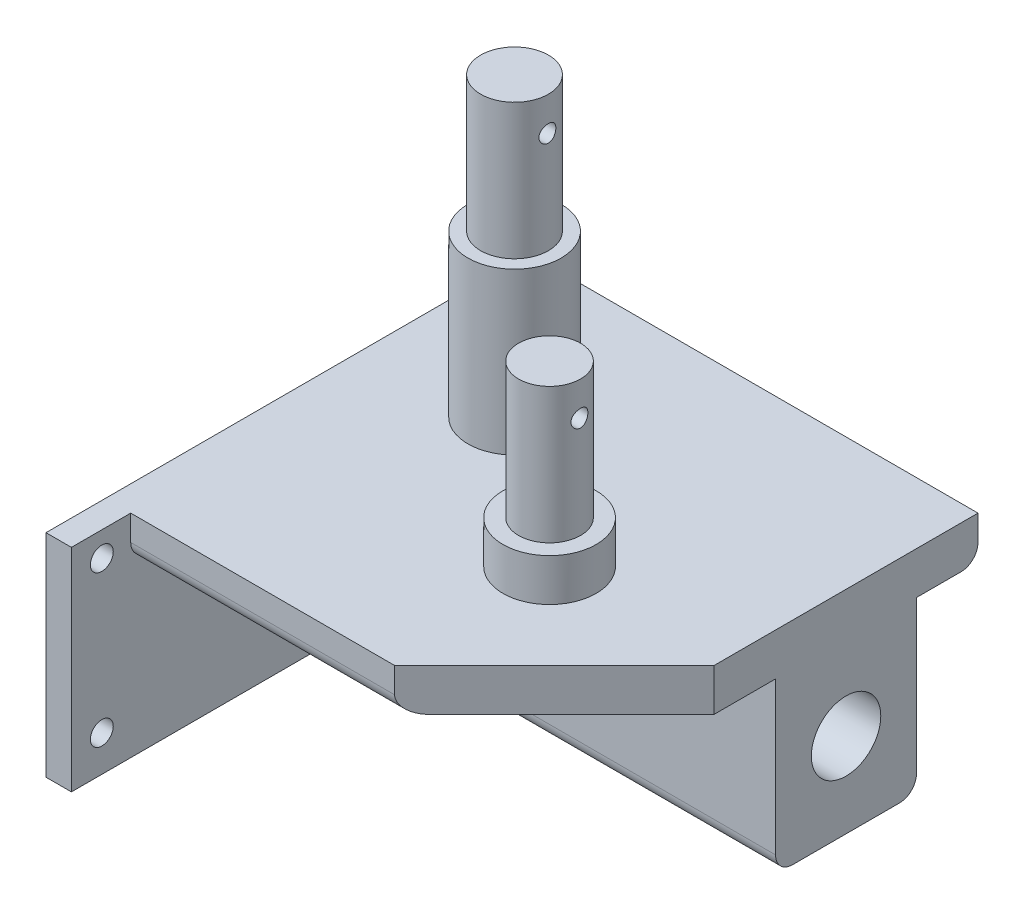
ISO-10303-21;
HEADER;
FILE_DESCRIPTION(('STEP AP214'),'2;1');
FILE_NAME('part.step','',(''),(''),'','','');
FILE_SCHEMA(('AUTOMOTIVE_DESIGN { 1 0 10303 214 1 1 1 1 }'));
ENDSEC;
DATA;
#1=APPLICATION_CONTEXT('core data for automotive mechanical design processes');
#2=APPLICATION_PROTOCOL_DEFINITION('international standard','automotive_design',2000,#1);
#3=PRODUCT_CONTEXT('',#1,'mechanical');
#4=PRODUCT('Part','Part','',(#3));
#5=PRODUCT_RELATED_PRODUCT_CATEGORY('part','',(#4));
#6=PRODUCT_DEFINITION_FORMATION('','',#4);
#7=PRODUCT_DEFINITION_CONTEXT('part definition',#1,'design');
#8=PRODUCT_DEFINITION('design','',#6,#7);
#9=PRODUCT_DEFINITION_SHAPE('','',#8);
#10=(LENGTH_UNIT() NAMED_UNIT(*) SI_UNIT(.MILLI.,.METRE.));
#11=(NAMED_UNIT(*) PLANE_ANGLE_UNIT() SI_UNIT($,.RADIAN.));
#12=(NAMED_UNIT(*) SI_UNIT($,.STERADIAN.) SOLID_ANGLE_UNIT());
#13=UNCERTAINTY_MEASURE_WITH_UNIT(LENGTH_MEASURE(1.E-05),#10,'distance_accuracy_value','');
#14=(GEOMETRIC_REPRESENTATION_CONTEXT(3) GLOBAL_UNCERTAINTY_ASSIGNED_CONTEXT((#13)) GLOBAL_UNIT_ASSIGNED_CONTEXT((#10,
#11,#12)) REPRESENTATION_CONTEXT('',''));
#15=CARTESIAN_POINT('',(0.,0.,0.));
#16=DIRECTION('',(0.,0.,1.));
#17=DIRECTION('',(1.,0.,0.));
#18=AXIS2_PLACEMENT_3D('',#15,#16,#17);
#19=CARTESIAN_POINT('',(0.,0.,0.));
#20=DIRECTION('',(0.,-1.,0.));
#21=DIRECTION('',(0.,0.,-1.));
#22=AXIS2_PLACEMENT_3D('',#19,#20,#21);
#23=PLANE('',#22);
#24=DIRECTION('',(0.,0.,1.));
#25=VECTOR('',#24,1.);
#26=CARTESIAN_POINT('',(-25.6189946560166,0.,25.6189946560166));
#27=LINE('',#26,#25);
#28=CARTESIAN_POINT('',(-25.6189946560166,0.,-22.3810053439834));
#29=VERTEX_POINT('',#28);
#30=CARTESIAN_POINT('',(-25.6189946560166,0.,-17.1193251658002));
#31=VERTEX_POINT('',#30);
#32=EDGE_CURVE('E247',#29,#31,#27,.T.);
#33=ORIENTED_EDGE('',*,*,#32,.F.);
#34=DIRECTION('',(-1.,0.,0.));
#35=VECTOR('',#34,1.);
#36=CARTESIAN_POINT('',(24.3810053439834,0.,-22.3810053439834));
#37=LINE('',#36,#35);
#38=CARTESIAN_POINT('',(24.3810053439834,0.,-22.3810053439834));
#39=VERTEX_POINT('',#38);
#40=EDGE_CURVE('E269',#29,#39,#37,.F.);
#41=ORIENTED_EDGE('',*,*,#40,.T.);
#42=DIRECTION('',(0.,0.,-1.));
#43=VECTOR('',#42,1.);
#44=CARTESIAN_POINT('',(24.3810053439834,0.,6.76758151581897));
#45=LINE('',#44,#43);
#46=CARTESIAN_POINT('',(24.3810053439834,0.,-17.1193251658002));
#47=VERTEX_POINT('',#46);
#48=EDGE_CURVE('E231',#47,#39,#45,.T.);
#49=ORIENTED_EDGE('',*,*,#48,.F.);
#50=DIRECTION('',(1.,0.,0.));
#51=VECTOR('',#50,1.);
#52=CARTESIAN_POINT('',(-25.6189946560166,0.,-17.1193251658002));
#53=LINE('',#52,#51);
#54=EDGE_CURVE('E218',#31,#47,#53,.T.);
#55=ORIENTED_EDGE('',*,*,#54,.F.);
#56=EDGE_LOOP('',(#33,#41,#49,#55));
#57=FACE_BOUND('',#56,.T.);
#58=ADVANCED_FACE('F35',(#57),#23,.T.);
#59=CARTESIAN_POINT('',(24.3810053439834,5.,6.76758151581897));
#60=DIRECTION('',(-1.,0.,0.));
#61=DIRECTION('',(0.,0.,1.));
#62=AXIS2_PLACEMENT_3D('',#59,#60,#61);
#63=PLANE('',#62);
#64=CARTESIAN_POINT('',(24.3810053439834,-10.,-8.80671191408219));
#65=DIRECTION('',(1.,0.,0.));
#66=DIRECTION('',(0.,0.,-1.));
#67=AXIS2_PLACEMENT_3D('',#64,#65,#66);
#68=CIRCLE('',#67,4.1);
#69=CARTESIAN_POINT('',(24.3810053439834,-10.,-12.9067119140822));
#70=VERTEX_POINT('',#69);
#71=EDGE_CURVE('E207',#70,#70,#68,.T.);
#72=ORIENTED_EDGE('',*,*,#71,.F.);
#73=EDGE_LOOP('',(#72));
#74=FACE_BOUND('',#73,.T.);
#75=ORIENTED_EDGE('',*,*,#48,.T.);
#76=CARTESIAN_POINT('',(24.3810053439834,2.,-22.3810053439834));
#77=DIRECTION('',(-1.,0.,0.));
#78=DIRECTION('',(0.,0.,1.));
#79=AXIS2_PLACEMENT_3D('',#76,#77,#78);
#80=CIRCLE('',#79,2.);
#81=CARTESIAN_POINT('',(24.3810053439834,2.,-24.3810053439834));
#82=VERTEX_POINT('',#81);
#83=EDGE_CURVE('E275',#39,#82,#80,.F.);
#84=ORIENTED_EDGE('',*,*,#83,.T.);
#85=DIRECTION('',(0.,-1.,0.));
#86=VECTOR('',#85,1.);
#87=CARTESIAN_POINT('',(24.3810053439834,5.,-24.3810053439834));
#88=LINE('',#87,#86);
#89=CARTESIAN_POINT('',(24.3810053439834,5.,-24.3810053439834));
#90=VERTEX_POINT('',#89);
#91=EDGE_CURVE('E257',#90,#82,#88,.T.);
#92=ORIENTED_EDGE('',*,*,#91,.F.);
#93=DIRECTION('',(0.,0.,-1.));
#94=VECTOR('',#93,1.);
#95=CARTESIAN_POINT('',(24.3810053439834,5.,6.76758151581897));
#96=LINE('',#95,#94);
#97=CARTESIAN_POINT('',(24.3810053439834,5.,6.76758151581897));
#98=VERTEX_POINT('',#97);
#99=EDGE_CURVE('E232',#98,#90,#96,.T.);
#100=ORIENTED_EDGE('',*,*,#99,.F.);
#101=DIRECTION('',(0.,-1.,0.));
#102=VECTOR('',#101,1.);
#103=CARTESIAN_POINT('',(24.3810053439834,5.,6.76758151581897));
#104=LINE('',#103,#102);
#105=CARTESIAN_POINT('',(24.3810053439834,0.,6.76758151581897));
#106=VERTEX_POINT('',#105);
#107=EDGE_CURVE('E242',#98,#106,#104,.T.);
#108=ORIENTED_EDGE('',*,*,#107,.T.);
#109=CARTESIAN_POINT('',(24.3810053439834,0.,-0.494098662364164));
#110=VERTEX_POINT('',#109);
#111=EDGE_CURVE('E243',#106,#110,#45,.T.);
#112=ORIENTED_EDGE('',*,*,#111,.T.);
#113=DIRECTION('',(0.,1.,0.));
#114=VECTOR('',#113,1.);
#115=CARTESIAN_POINT('',(24.3810053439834,-20.,-0.494098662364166));
#116=LINE('',#115,#114);
#117=CARTESIAN_POINT('',(24.3810053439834,-18.,-0.494098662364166));
#118=VERTEX_POINT('',#117);
#119=EDGE_CURVE('E229',#118,#110,#116,.T.);
#120=ORIENTED_EDGE('',*,*,#119,.F.);
#121=CARTESIAN_POINT('',(24.3810053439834,-18.,-2.49409866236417));
#122=DIRECTION('',(-1.,0.,0.));
#123=DIRECTION('',(0.,0.,1.));
#124=AXIS2_PLACEMENT_3D('',#121,#122,#123);
#125=CIRCLE('',#124,2.);
#126=CARTESIAN_POINT('',(24.3810053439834,-20.,-2.49409866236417));
#127=VERTEX_POINT('',#126);
#128=EDGE_CURVE('E271',#118,#127,#125,.F.);
#129=ORIENTED_EDGE('',*,*,#128,.T.);
#130=DIRECTION('',(0.,0.,1.));
#131=VECTOR('',#130,1.);
#132=CARTESIAN_POINT('',(24.3810053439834,-20.,-0.494098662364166));
#133=LINE('',#132,#131);
#134=CARTESIAN_POINT('',(24.3810053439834,-20.,-15.1193251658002));
#135=VERTEX_POINT('',#134);
#136=EDGE_CURVE('E214',#135,#127,#133,.T.);
#137=ORIENTED_EDGE('',*,*,#136,.F.);
#138=CARTESIAN_POINT('',(24.3810053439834,-18.,-15.1193251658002));
#139=DIRECTION('',(-1.,0.,0.));
#140=DIRECTION('',(0.,0.,1.));
#141=AXIS2_PLACEMENT_3D('',#138,#139,#140);
#142=CIRCLE('',#141,2.);
#143=CARTESIAN_POINT('',(24.3810053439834,-18.,-17.1193251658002));
#144=VERTEX_POINT('',#143);
#145=EDGE_CURVE('E273',#135,#144,#142,.F.);
#146=ORIENTED_EDGE('',*,*,#145,.T.);
#147=DIRECTION('',(0.,1.,0.));
#148=VECTOR('',#147,1.);
#149=CARTESIAN_POINT('',(24.3810053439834,-20.,-17.1193251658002));
#150=LINE('',#149,#148);
#151=EDGE_CURVE('E217',#144,#47,#150,.T.);
#152=ORIENTED_EDGE('',*,*,#151,.T.);
#153=EDGE_LOOP('',(#75,#84,#92,#100,#108,#112,#120,#129,#137,#146,#152));
#154=FACE_BOUND('',#153,.T.);
#155=ADVANCED_FACE('F325',(#74,#154),#63,.F.);
#156=CARTESIAN_POINT('',(-25.6189946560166,5.,-24.3810053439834));
#157=DIRECTION('',(0.,0.,1.));
#158=DIRECTION('',(1.,0.,0.));
#159=AXIS2_PLACEMENT_3D('',#156,#157,#158);
#160=PLANE('',#159);
#161=ORIENTED_EDGE('',*,*,#91,.T.);
#162=DIRECTION('',(-1.,0.,0.));
#163=VECTOR('',#162,1.);
#164=CARTESIAN_POINT('',(-25.6189946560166,2.,-24.3810053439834));
#165=LINE('',#164,#163);
#166=CARTESIAN_POINT('',(-25.6189946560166,2.,-24.3810053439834));
#167=VERTEX_POINT('',#166);
#168=EDGE_CURVE('E259',#82,#167,#165,.T.);
#169=ORIENTED_EDGE('',*,*,#168,.T.);
#170=DIRECTION('',(0.,-1.,0.));
#171=VECTOR('',#170,1.);
#172=CARTESIAN_POINT('',(-25.6189946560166,5.,-24.3810053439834));
#173=LINE('',#172,#171);
#174=CARTESIAN_POINT('',(-25.6189946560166,-20.,-24.3810053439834));
#175=VERTEX_POINT('',#174);
#176=EDGE_CURVE('E179',#167,#175,#173,.T.);
#177=ORIENTED_EDGE('',*,*,#176,.T.);
#178=DIRECTION('',(1.,0.,0.));
#179=VECTOR('',#178,1.);
#180=CARTESIAN_POINT('',(-28.6189946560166,-20.,-24.3810053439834));
#181=LINE('',#180,#179);
#182=CARTESIAN_POINT('',(-28.6189946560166,-20.,-24.3810053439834));
#183=VERTEX_POINT('',#182);
#184=EDGE_CURVE('E160',#183,#175,#181,.T.);
#185=ORIENTED_EDGE('',*,*,#184,.F.);
#186=DIRECTION('',(0.,-1.,0.));
#187=VECTOR('',#186,1.);
#188=CARTESIAN_POINT('',(-28.6189946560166,5.,-24.3810053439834));
#189=LINE('',#188,#187);
#190=CARTESIAN_POINT('',(-28.6189946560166,5.,-24.3810053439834));
#191=VERTEX_POINT('',#190);
#192=EDGE_CURVE('E166',#191,#183,#189,.T.);
#193=ORIENTED_EDGE('',*,*,#192,.F.);
#194=DIRECTION('',(-1.,0.,0.));
#195=VECTOR('',#194,1.);
#196=CARTESIAN_POINT('',(-25.6189946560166,5.,-24.3810053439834));
#197=LINE('',#196,#195);
#198=EDGE_CURVE('E235',#90,#191,#197,.T.);
#199=ORIENTED_EDGE('',*,*,#198,.F.);
#200=EDGE_LOOP('',(#161,#169,#177,#185,#193,#199));
#201=FACE_BOUND('',#200,.T.);
#202=ADVANCED_FACE('F177',(#201),#160,.F.);
#203=CARTESIAN_POINT('',(-25.6189946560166,5.,25.6189946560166));
#204=DIRECTION('',(0.,0.,-1.));
#205=DIRECTION('',(-1.,0.,0.));
#206=AXIS2_PLACEMENT_3D('',#203,#204,#205);
#207=PLANE('',#206);
#208=DIRECTION('',(0.,-1.,0.));
#209=VECTOR('',#208,1.);
#210=CARTESIAN_POINT('',(-25.6189946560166,5.,25.6189946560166));
#211=LINE('',#210,#209);
#212=CARTESIAN_POINT('',(-25.6189946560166,5.,25.6189946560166));
#213=VERTEX_POINT('',#212);
#214=CARTESIAN_POINT('',(-25.6189946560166,2.,25.6189946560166));
#215=VERTEX_POINT('',#214);
#216=EDGE_CURVE('E254',#213,#215,#211,.T.);
#217=ORIENTED_EDGE('',*,*,#216,.T.);
#218=DIRECTION('',(1.,0.,0.));
#219=VECTOR('',#218,1.);
#220=CARTESIAN_POINT('',(5.52959220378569,2.,25.6189946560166));
#221=LINE('',#220,#219);
#222=CARTESIAN_POINT('',(5.52959220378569,2.,25.6189946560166));
#223=VERTEX_POINT('',#222);
#224=EDGE_CURVE('E277',#215,#223,#221,.T.);
#225=ORIENTED_EDGE('',*,*,#224,.T.);
#226=DIRECTION('',(0.,-1.,0.));
#227=VECTOR('',#226,1.);
#228=CARTESIAN_POINT('',(5.52959220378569,5.,25.6189946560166));
#229=LINE('',#228,#227);
#230=CARTESIAN_POINT('',(5.52959220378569,5.,25.6189946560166));
#231=VERTEX_POINT('',#230);
#232=EDGE_CURVE('E252',#231,#223,#229,.T.);
#233=ORIENTED_EDGE('',*,*,#232,.F.);
#234=DIRECTION('',(1.,0.,0.));
#235=VECTOR('',#234,1.);
#236=CARTESIAN_POINT('',(-25.6189946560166,5.,25.6189946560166));
#237=LINE('',#236,#235);
#238=EDGE_CURVE('E238',#213,#231,#237,.T.);
#239=ORIENTED_EDGE('',*,*,#238,.F.);
#240=EDGE_LOOP('',(#217,#225,#233,#239));
#241=FACE_BOUND('',#240,.T.);
#242=ADVANCED_FACE('F362',(#241),#207,.F.);
#243=CARTESIAN_POINT('',(5.52959220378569,5.,25.6189946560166));
#244=DIRECTION('',(-0.707106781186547,0.,-0.707106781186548));
#245=DIRECTION('',(-0.707106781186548,0.,0.707106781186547));
#246=AXIS2_PLACEMENT_3D('',#243,#244,#245);
#247=PLANE('',#246);
#248=ORIENTED_EDGE('',*,*,#232,.T.);
#249=CARTESIAN_POINT('',(7.52959220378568,2.,23.6189946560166));
#250=DIRECTION('',(-0.707106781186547,0.,-0.707106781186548));
#251=DIRECTION('',(-0.707106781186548,0.,0.707106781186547));
#252=AXIS2_PLACEMENT_3D('',#249,#250,#251);
#253=ELLIPSE('',#252,2.82842712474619,2.);
#254=CARTESIAN_POINT('',(7.52959220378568,0.,23.6189946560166));
#255=VERTEX_POINT('',#254);
#256=EDGE_CURVE('E56',#223,#255,#253,.F.);
#257=ORIENTED_EDGE('',*,*,#256,.T.);
#258=DIRECTION('',(0.707106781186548,0.,-0.707106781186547));
#259=VECTOR('',#258,1.);
#260=CARTESIAN_POINT('',(5.52959220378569,0.,25.6189946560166));
#261=LINE('',#260,#259);
#262=EDGE_CURVE('E236',#255,#106,#261,.T.);
#263=ORIENTED_EDGE('',*,*,#262,.T.);
#264=ORIENTED_EDGE('',*,*,#107,.F.);
#265=DIRECTION('',(0.707106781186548,0.,-0.707106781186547));
#266=VECTOR('',#265,1.);
#267=CARTESIAN_POINT('',(5.52959220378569,5.,25.6189946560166));
#268=LINE('',#267,#266);
#269=EDGE_CURVE('E240',#231,#98,#268,.T.);
#270=ORIENTED_EDGE('',*,*,#269,.F.);
#271=EDGE_LOOP('',(#248,#257,#263,#264,#270));
#272=FACE_BOUND('',#271,.T.);
#273=ADVANCED_FACE('F348',(#272),#247,.F.);
#274=CARTESIAN_POINT('',(0.,5.,0.));
#275=DIRECTION('',(0.,-1.,0.));
#276=DIRECTION('',(0.,0.,-1.));
#277=AXIS2_PLACEMENT_3D('',#274,#275,#276);
#278=PLANE('',#277);
#279=CARTESIAN_POINT('',(-12.7876026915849,5.,-6.84956130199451));
#280=DIRECTION('',(0.,-1.,0.));
#281=DIRECTION('',(0.,0.,-1.));
#282=AXIS2_PLACEMENT_3D('',#279,#280,#281);
#283=CIRCLE('',#282,5.5);
#284=CARTESIAN_POINT('',(-12.7876026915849,5.,-12.3495613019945));
#285=VERTEX_POINT('',#284);
#286=EDGE_CURVE('E11',#285,#285,#283,.F.);
#287=ORIENTED_EDGE('',*,*,#286,.F.);
#288=EDGE_LOOP('',(#287));
#289=FACE_BOUND('',#288,.T.);
#290=CARTESIAN_POINT('',(4.55989160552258,5.,6.36514758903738));
#291=DIRECTION('',(0.,-1.,0.));
#292=DIRECTION('',(0.,0.,-1.));
#293=AXIS2_PLACEMENT_3D('',#290,#291,#292);
#294=CIRCLE('',#293,5.5);
#295=CARTESIAN_POINT('',(4.55989160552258,5.,0.865147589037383));
#296=VERTEX_POINT('',#295);
#297=EDGE_CURVE('E48',#296,#296,#294,.F.);
#298=ORIENTED_EDGE('',*,*,#297,.F.);
#299=EDGE_LOOP('',(#298));
#300=FACE_BOUND('',#299,.T.);
#301=ORIENTED_EDGE('',*,*,#99,.T.);
#302=ORIENTED_EDGE('',*,*,#198,.T.);
#303=DIRECTION('',(0.,0.,-1.));
#304=VECTOR('',#303,1.);
#305=CARTESIAN_POINT('',(-28.6189946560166,5.,-24.3810053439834));
#306=LINE('',#305,#304);
#307=CARTESIAN_POINT('',(-28.6189946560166,5.,32.6189946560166));
#308=VERTEX_POINT('',#307);
#309=EDGE_CURVE('E172',#308,#191,#306,.T.);
#310=ORIENTED_EDGE('',*,*,#309,.F.);
#311=DIRECTION('',(1.,0.,0.));
#312=VECTOR('',#311,1.);
#313=CARTESIAN_POINT('',(-28.6189946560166,5.,32.6189946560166));
#314=LINE('',#313,#312);
#315=CARTESIAN_POINT('',(-25.6189946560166,5.,32.6189946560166));
#316=VERTEX_POINT('',#315);
#317=EDGE_CURVE('E184',#308,#316,#314,.T.);
#318=ORIENTED_EDGE('',*,*,#317,.T.);
#319=DIRECTION('',(0.,0.,-1.));
#320=VECTOR('',#319,1.);
#321=CARTESIAN_POINT('',(-25.6189946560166,5.,-24.3810053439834));
#322=LINE('',#321,#320);
#323=EDGE_CURVE('E174',#316,#213,#322,.T.);
#324=ORIENTED_EDGE('',*,*,#323,.T.);
#325=ORIENTED_EDGE('',*,*,#238,.T.);
#326=ORIENTED_EDGE('',*,*,#269,.T.);
#327=EDGE_LOOP('',(#301,#302,#310,#318,#324,#325,#326));
#328=FACE_BOUND('',#327,.T.);
#329=ADVANCED_FACE('F339',(#289,#300,#328),#278,.F.);
#330=ORIENTED_EDGE('',*,*,#262,.F.);
#331=DIRECTION('',(1.,0.,0.));
#332=VECTOR('',#331,1.);
#333=CARTESIAN_POINT('',(-25.6189946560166,0.,23.6189946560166));
#334=LINE('',#333,#332);
#335=CARTESIAN_POINT('',(-25.6189946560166,0.,23.6189946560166));
#336=VERTEX_POINT('',#335);
#337=EDGE_CURVE('E280',#255,#336,#334,.F.);
#338=ORIENTED_EDGE('',*,*,#337,.T.);
#339=CARTESIAN_POINT('',(-25.6189946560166,0.,-0.494098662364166));
#340=VERTEX_POINT('',#339);
#341=EDGE_CURVE('E246',#340,#336,#27,.T.);
#342=ORIENTED_EDGE('',*,*,#341,.F.);
#343=DIRECTION('',(-1.,0.,0.));
#344=VECTOR('',#343,1.);
#345=CARTESIAN_POINT('',(-25.6189946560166,0.,-0.494098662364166));
#346=LINE('',#345,#344);
#347=EDGE_CURVE('E211',#110,#340,#346,.T.);
#348=ORIENTED_EDGE('',*,*,#347,.F.);
#349=ORIENTED_EDGE('',*,*,#111,.F.);
#350=EDGE_LOOP('',(#330,#338,#342,#348,#349));
#351=FACE_BOUND('',#350,.T.);
#352=ADVANCED_FACE('F328',(#351),#23,.T.);
#353=CARTESIAN_POINT('',(-25.6189946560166,-20.,-0.494098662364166));
#354=DIRECTION('',(0.,0.,-1.));
#355=DIRECTION('',(-1.,0.,0.));
#356=AXIS2_PLACEMENT_3D('',#353,#354,#355);
#357=PLANE('',#356);
#358=DIRECTION('',(0.,1.,0.));
#359=VECTOR('',#358,1.);
#360=CARTESIAN_POINT('',(-25.6189946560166,-20.,-0.494098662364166));
#361=LINE('',#360,#359);
#362=CARTESIAN_POINT('',(-25.6189946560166,-18.,-0.494098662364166));
#363=VERTEX_POINT('',#362);
#364=EDGE_CURVE('E227',#363,#340,#361,.T.);
#365=ORIENTED_EDGE('',*,*,#364,.F.);
#366=DIRECTION('',(-1.,0.,0.));
#367=VECTOR('',#366,1.);
#368=CARTESIAN_POINT('',(24.3810053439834,-18.,-0.494098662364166));
#369=LINE('',#368,#367);
#370=EDGE_CURVE('E291',#363,#118,#369,.F.);
#371=ORIENTED_EDGE('',*,*,#370,.T.);
#372=ORIENTED_EDGE('',*,*,#119,.T.);
#373=ORIENTED_EDGE('',*,*,#347,.T.);
#374=EDGE_LOOP('',(#365,#371,#372,#373));
#375=FACE_BOUND('',#374,.T.);
#376=ADVANCED_FACE('F338',(#375),#357,.F.);
#377=CARTESIAN_POINT('',(-25.6189946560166,-20.,-17.1193251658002));
#378=DIRECTION('',(0.,0.,1.));
#379=DIRECTION('',(1.,0.,0.));
#380=AXIS2_PLACEMENT_3D('',#377,#378,#379);
#381=PLANE('',#380);
#382=ORIENTED_EDGE('',*,*,#151,.F.);
#383=DIRECTION('',(1.,0.,0.));
#384=VECTOR('',#383,1.);
#385=CARTESIAN_POINT('',(-25.6189946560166,-18.,-17.1193251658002));
#386=LINE('',#385,#384);
#387=CARTESIAN_POINT('',(-25.6189946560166,-18.,-17.1193251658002));
#388=VERTEX_POINT('',#387);
#389=EDGE_CURVE('E288',#144,#388,#386,.F.);
#390=ORIENTED_EDGE('',*,*,#389,.T.);
#391=DIRECTION('',(0.,1.,0.));
#392=VECTOR('',#391,1.);
#393=CARTESIAN_POINT('',(-25.6189946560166,-20.,-17.1193251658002));
#394=LINE('',#393,#392);
#395=EDGE_CURVE('E224',#388,#31,#394,.T.);
#396=ORIENTED_EDGE('',*,*,#395,.T.);
#397=ORIENTED_EDGE('',*,*,#54,.T.);
#398=EDGE_LOOP('',(#382,#390,#396,#397));
#399=FACE_BOUND('',#398,.T.);
#400=ADVANCED_FACE('F345',(#399),#381,.F.);
#401=CARTESIAN_POINT('',(0.,-20.,0.));
#402=DIRECTION('',(0.,-1.,0.));
#403=DIRECTION('',(0.,0.,-1.));
#404=AXIS2_PLACEMENT_3D('',#401,#402,#403);
#405=PLANE('',#404);
#406=DIRECTION('',(-1.,0.,0.));
#407=VECTOR('',#406,1.);
#408=CARTESIAN_POINT('',(-25.6189946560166,-20.,-2.49409866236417));
#409=LINE('',#408,#407);
#410=CARTESIAN_POINT('',(-25.6189946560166,-20.,-2.49409866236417));
#411=VERTEX_POINT('',#410);
#412=EDGE_CURVE('E283',#127,#411,#409,.T.);
#413=ORIENTED_EDGE('',*,*,#412,.T.);
#414=DIRECTION('',(0.,0.,1.));
#415=VECTOR('',#414,1.);
#416=CARTESIAN_POINT('',(-25.6189946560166,-20.,-24.3810053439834));
#417=LINE('',#416,#415);
#418=CARTESIAN_POINT('',(-25.6189946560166,-20.,32.6189946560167));
#419=VERTEX_POINT('',#418);
#420=EDGE_CURVE('E377',#411,#419,#417,.T.);
#421=ORIENTED_EDGE('',*,*,#420,.T.);
#422=DIRECTION('',(1.,0.,0.));
#423=VECTOR('',#422,1.);
#424=CARTESIAN_POINT('',(-28.6189946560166,-20.,32.6189946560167));
#425=LINE('',#424,#423);
#426=CARTESIAN_POINT('',(-28.6189946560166,-20.,32.6189946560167));
#427=VERTEX_POINT('',#426);
#428=EDGE_CURVE('E162',#427,#419,#425,.T.);
#429=ORIENTED_EDGE('',*,*,#428,.F.);
#430=DIRECTION('',(0.,0.,1.));
#431=VECTOR('',#430,1.);
#432=CARTESIAN_POINT('',(-28.6189946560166,-20.,-24.3810053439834));
#433=LINE('',#432,#431);
#434=EDGE_CURVE('E154',#183,#427,#433,.T.);
#435=ORIENTED_EDGE('',*,*,#434,.F.);
#436=ORIENTED_EDGE('',*,*,#184,.T.);
#437=CARTESIAN_POINT('',(-25.6189946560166,-20.,-15.1193251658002));
#438=VERTEX_POINT('',#437);
#439=EDGE_CURVE('E371',#175,#438,#417,.T.);
#440=ORIENTED_EDGE('',*,*,#439,.T.);
#441=DIRECTION('',(1.,0.,0.));
#442=VECTOR('',#441,1.);
#443=CARTESIAN_POINT('',(24.3810053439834,-20.,-15.1193251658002));
#444=LINE('',#443,#442);
#445=EDGE_CURVE('E285',#438,#135,#444,.T.);
#446=ORIENTED_EDGE('',*,*,#445,.T.);
#447=ORIENTED_EDGE('',*,*,#136,.T.);
#448=EDGE_LOOP('',(#413,#421,#429,#435,#436,#440,#446,#447));
#449=FACE_BOUND('',#448,.T.);
#450=ADVANCED_FACE('F157',(#449),#405,.T.);
#451=CARTESIAN_POINT('',(-5.61899465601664,-10.,-8.80671191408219));
#452=DIRECTION('',(1.,0.,0.));
#453=DIRECTION('',(0.,0.,-1.));
#454=AXIS2_PLACEMENT_3D('',#451,#452,#453);
#455=CYLINDRICAL_SURFACE('',#454,4.1);
#456=CARTESIAN_POINT('',(-5.61899465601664,-10.,-8.80671191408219));
#457=DIRECTION('',(1.,0.,0.));
#458=DIRECTION('',(0.,0.,-1.));
#459=AXIS2_PLACEMENT_3D('',#456,#457,#458);
#460=CIRCLE('',#459,4.1);
#461=CARTESIAN_POINT('',(-5.61899465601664,-10.,-12.9067119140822));
#462=VERTEX_POINT('',#461);
#463=EDGE_CURVE('E208',#462,#462,#460,.T.);
#464=ORIENTED_EDGE('',*,*,#463,.F.);
#465=EDGE_LOOP('',(#464));
#466=FACE_BOUND('',#465,.T.);
#467=ORIENTED_EDGE('',*,*,#71,.T.);
#468=EDGE_LOOP('',(#467));
#469=FACE_BOUND('',#468,.T.);
#470=ADVANCED_FACE('F445',(#466,#469),#455,.F.);
#471=CARTESIAN_POINT('',(-5.61899465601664,-10.,-8.80671191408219));
#472=DIRECTION('',(1.,0.,0.));
#473=DIRECTION('',(0.,0.,-1.));
#474=AXIS2_PLACEMENT_3D('',#471,#472,#473);
#475=PLANE('',#474);
#476=ORIENTED_EDGE('',*,*,#463,.T.);
#477=EDGE_LOOP('',(#476));
#478=FACE_BOUND('',#477,.T.);
#479=ADVANCED_FACE('F420',(#478),#475,.T.);
#480=CARTESIAN_POINT('',(-25.6189946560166,2.,-22.3810053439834));
#481=DIRECTION('',(1.,0.,0.));
#482=DIRECTION('',(0.,0.,-1.));
#483=AXIS2_PLACEMENT_3D('',#480,#481,#482);
#484=CYLINDRICAL_SURFACE('',#483,2.);
#485=ORIENTED_EDGE('',*,*,#83,.F.);
#486=ORIENTED_EDGE('',*,*,#40,.F.);
#487=CARTESIAN_POINT('',(-25.6189946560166,2.,-22.3810053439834));
#488=DIRECTION('',(1.,0.,0.));
#489=DIRECTION('',(0.,0.,-1.));
#490=AXIS2_PLACEMENT_3D('',#487,#488,#489);
#491=CIRCLE('',#490,2.);
#492=EDGE_CURVE('E267',#167,#29,#491,.F.);
#493=ORIENTED_EDGE('',*,*,#492,.F.);
#494=ORIENTED_EDGE('',*,*,#168,.F.);
#495=EDGE_LOOP('',(#485,#486,#493,#494));
#496=FACE_BOUND('',#495,.T.);
#497=ADVANCED_FACE('F391',(#496),#484,.T.);
#498=CARTESIAN_POINT('',(-25.6189946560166,2.,23.6189946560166));
#499=DIRECTION('',(-1.,0.,0.));
#500=DIRECTION('',(0.,0.,1.));
#501=AXIS2_PLACEMENT_3D('',#498,#499,#500);
#502=CYLINDRICAL_SURFACE('',#501,2.);
#503=CARTESIAN_POINT('',(-25.6189946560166,2.,23.6189946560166));
#504=DIRECTION('',(1.,0.,0.));
#505=DIRECTION('',(0.,0.,-1.));
#506=AXIS2_PLACEMENT_3D('',#503,#504,#505);
#507=CIRCLE('',#506,2.);
#508=EDGE_CURVE('E265',#336,#215,#507,.F.);
#509=ORIENTED_EDGE('',*,*,#508,.F.);
#510=ORIENTED_EDGE('',*,*,#337,.F.);
#511=ORIENTED_EDGE('',*,*,#256,.F.);
#512=ORIENTED_EDGE('',*,*,#224,.F.);
#513=EDGE_LOOP('',(#509,#510,#511,#512));
#514=FACE_BOUND('',#513,.T.);
#515=ADVANCED_FACE('F355',(#514),#502,.T.);
#516=CARTESIAN_POINT('',(0.,-18.,-15.1193251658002));
#517=DIRECTION('',(-1.,0.,0.));
#518=DIRECTION('',(0.,0.,1.));
#519=AXIS2_PLACEMENT_3D('',#516,#517,#518);
#520=CYLINDRICAL_SURFACE('',#519,2.);
#521=CARTESIAN_POINT('',(-25.6189946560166,-18.,-15.1193251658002));
#522=DIRECTION('',(1.,0.,0.));
#523=DIRECTION('',(0.,0.,-1.));
#524=AXIS2_PLACEMENT_3D('',#521,#522,#523);
#525=CIRCLE('',#524,2.);
#526=EDGE_CURVE('E263',#388,#438,#525,.F.);
#527=ORIENTED_EDGE('',*,*,#526,.F.);
#528=ORIENTED_EDGE('',*,*,#389,.F.);
#529=ORIENTED_EDGE('',*,*,#145,.F.);
#530=ORIENTED_EDGE('',*,*,#445,.F.);
#531=EDGE_LOOP('',(#527,#528,#529,#530));
#532=FACE_BOUND('',#531,.T.);
#533=ADVANCED_FACE('F403',(#532),#520,.T.);
#534=CARTESIAN_POINT('',(0.,-18.,-2.49409866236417));
#535=DIRECTION('',(1.,0.,0.));
#536=DIRECTION('',(0.,0.,-1.));
#537=AXIS2_PLACEMENT_3D('',#534,#535,#536);
#538=CYLINDRICAL_SURFACE('',#537,2.);
#539=ORIENTED_EDGE('',*,*,#128,.F.);
#540=ORIENTED_EDGE('',*,*,#370,.F.);
#541=CARTESIAN_POINT('',(-25.6189946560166,-18.,-2.49409866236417));
#542=DIRECTION('',(1.,0.,0.));
#543=DIRECTION('',(0.,0.,-1.));
#544=AXIS2_PLACEMENT_3D('',#541,#542,#543);
#545=CIRCLE('',#544,2.);
#546=EDGE_CURVE('E261',#411,#363,#545,.F.);
#547=ORIENTED_EDGE('',*,*,#546,.F.);
#548=ORIENTED_EDGE('',*,*,#412,.F.);
#549=EDGE_LOOP('',(#539,#540,#547,#548));
#550=FACE_BOUND('',#549,.T.);
#551=ADVANCED_FACE('F37',(#550),#538,.T.);
#552=CARTESIAN_POINT('',(4.55989160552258,10.,6.36514758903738));
#553=DIRECTION('',(0.,-1.,0.));
#554=DIRECTION('',(0.,0.,-1.));
#555=AXIS2_PLACEMENT_3D('',#552,#553,#554);
#556=CYLINDRICAL_SURFACE('',#555,5.5);
#557=CARTESIAN_POINT('',(4.55989160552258,10.,6.36514758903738));
#558=DIRECTION('',(0.,1.,0.));
#559=DIRECTION('',(0.,0.,1.));
#560=AXIS2_PLACEMENT_3D('',#557,#558,#559);
#561=CIRCLE('',#560,5.5);
#562=CARTESIAN_POINT('',(4.55989160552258,10.,11.8651475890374));
#563=VERTEX_POINT('',#562);
#564=EDGE_CURVE('E202',#563,#563,#561,.T.);
#565=ORIENTED_EDGE('',*,*,#564,.F.);
#566=EDGE_LOOP('',(#565));
#567=FACE_BOUND('',#566,.T.);
#568=ORIENTED_EDGE('',*,*,#297,.T.);
#569=EDGE_LOOP('',(#568));
#570=FACE_BOUND('',#569,.T.);
#571=ADVANCED_FACE('F426',(#567,#570),#556,.T.);
#572=CARTESIAN_POINT('',(4.55989160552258,10.,6.36514758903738));
#573=DIRECTION('',(0.,1.,0.));
#574=DIRECTION('',(0.,0.,1.));
#575=AXIS2_PLACEMENT_3D('',#572,#573,#574);
#576=PLANE('',#575);
#577=CARTESIAN_POINT('',(4.55989160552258,10.,6.36514758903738));
#578=DIRECTION('',(0.,1.,0.));
#579=DIRECTION('',(0.,0.,1.));
#580=AXIS2_PLACEMENT_3D('',#577,#578,#579);
#581=CIRCLE('',#580,3.65870155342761);
#582=CARTESIAN_POINT('',(4.55989160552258,10.,10.023849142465));
#583=VERTEX_POINT('',#582);
#584=EDGE_CURVE('E198',#583,#583,#581,.T.);
#585=ORIENTED_EDGE('',*,*,#584,.F.);
#586=EDGE_LOOP('',(#585));
#587=FACE_BOUND('',#586,.T.);
#588=ORIENTED_EDGE('',*,*,#564,.T.);
#589=EDGE_LOOP('',(#588));
#590=FACE_BOUND('',#589,.T.);
#591=ADVANCED_FACE('F430',(#587,#590),#576,.T.);
#592=CARTESIAN_POINT('',(-12.7876026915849,10.,-6.84956130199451));
#593=DIRECTION('',(0.,-1.,0.));
#594=DIRECTION('',(0.,0.,-1.));
#595=AXIS2_PLACEMENT_3D('',#592,#593,#594);
#596=CYLINDRICAL_SURFACE('',#595,5.5);
#597=ORIENTED_EDGE('',*,*,#286,.T.);
#598=EDGE_LOOP('',(#597));
#599=FACE_BOUND('',#598,.T.);
#600=CARTESIAN_POINT('',(-12.7876026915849,24.,-6.84956130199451));
#601=DIRECTION('',(0.,1.,0.));
#602=DIRECTION('',(0.,0.,1.));
#603=AXIS2_PLACEMENT_3D('',#600,#601,#602);
#604=CIRCLE('',#603,5.5);
#605=CARTESIAN_POINT('',(-12.7876026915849,24.,-1.34956130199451));
#606=VERTEX_POINT('',#605);
#607=EDGE_CURVE('E191',#606,#606,#604,.T.);
#608=ORIENTED_EDGE('',*,*,#607,.F.);
#609=EDGE_LOOP('',(#608));
#610=FACE_BOUND('',#609,.T.);
#611=ADVANCED_FACE('F436',(#599,#610),#596,.T.);
#612=CARTESIAN_POINT('',(4.55989160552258,26.,6.36514758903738));
#613=DIRECTION('',(0.,-1.,0.));
#614=DIRECTION('',(0.,0.,-1.));
#615=AXIS2_PLACEMENT_3D('',#612,#613,#614);
#616=CYLINDRICAL_SURFACE('',#615,3.65870155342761);
#617=CARTESIAN_POINT('',(8.07928033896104,22.,7.36514758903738));
#618=CARTESIAN_POINT('',(8.07928123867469,22.0550326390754,7.36514637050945));
#619=CARTESIAN_POINT('',(8.08058527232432,22.110077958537,7.36058922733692));
#620=CARTESIAN_POINT('',(8.08564393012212,22.2185751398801,7.34251793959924));
#621=CARTESIAN_POINT('',(8.08939970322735,22.2720262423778,7.32899959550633));
#622=CARTESIAN_POINT('',(8.09890540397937,22.3757496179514,7.29348649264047));
#623=CARTESIAN_POINT('',(8.10465242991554,22.4260263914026,7.27150406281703));
#624=CARTESIAN_POINT('',(8.11748934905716,22.5221871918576,7.21972581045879));
#625=CARTESIAN_POINT('',(8.12457936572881,22.5680708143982,7.18992926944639));
#626=CARTESIAN_POINT('',(8.1395121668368,22.6553482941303,7.12253130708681));
#627=CARTESIAN_POINT('',(8.14736883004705,22.6966096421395,7.08476133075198));
#628=CARTESIAN_POINT('',(8.16283012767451,22.7722982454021,7.0028509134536));
#629=CARTESIAN_POINT('',(8.17043473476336,22.8067247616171,6.95870978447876));
#630=CARTESIAN_POINT('',(8.1846904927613,22.8683233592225,6.86438667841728));
#631=CARTESIAN_POINT('',(8.19132336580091,22.8953630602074,6.81411524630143));
#632=CARTESIAN_POINT('',(8.2027286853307,22.9405560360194,6.70952794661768));
#633=CARTESIAN_POINT('',(8.2075014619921,22.9587108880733,6.65521279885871));
#634=CARTESIAN_POINT('',(8.21455067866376,22.9851881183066,6.54546364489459));
#635=CARTESIAN_POINT('',(8.21688429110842,22.9937360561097,6.49008779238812));
#636=CARTESIAN_POINT('',(8.2189924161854,23.0014671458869,6.37864214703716));
#637=CARTESIAN_POINT('',(8.21876737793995,23.0006519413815,6.3225724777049));
#638=CARTESIAN_POINT('',(8.21582516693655,22.9898373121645,6.21290315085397));
#639=CARTESIAN_POINT('',(8.2131741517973,22.9800816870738,6.15927740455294));
#640=CARTESIAN_POINT('',(8.2057563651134,22.9520578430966,6.05445525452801));
#641=CARTESIAN_POINT('',(8.200989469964,22.9337891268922,6.00325899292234));
#642=CARTESIAN_POINT('',(8.18977868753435,22.8890750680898,5.9041349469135));
#643=CARTESIAN_POINT('',(8.18331804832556,22.8625475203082,5.85624621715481));
#644=CARTESIAN_POINT('',(8.16941386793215,22.802132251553,5.7655178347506));
#645=CARTESIAN_POINT('',(8.16197012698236,22.7682430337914,5.72267921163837));
#646=CARTESIAN_POINT('',(8.14662165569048,22.6927777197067,5.64181166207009));
#647=CARTESIAN_POINT('',(8.13870979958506,22.6509892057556,5.60398207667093));
#648=CARTESIAN_POINT('',(8.12353184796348,22.5615800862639,5.53581767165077));
#649=CARTESIAN_POINT('',(8.11626579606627,22.513959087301,5.50548335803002));
#650=CARTESIAN_POINT('',(8.1031724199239,22.4137871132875,5.45300846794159));
#651=CARTESIAN_POINT('',(8.09735515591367,22.3612049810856,5.43092468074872));
#652=CARTESIAN_POINT('',(8.08794166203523,22.2528750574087,5.39597728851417));
#653=CARTESIAN_POINT('',(8.08434484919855,22.1971281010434,5.38311126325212));
#654=CARTESIAN_POINT('',(8.07990443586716,22.0859216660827,5.36731371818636));
#655=CARTESIAN_POINT('',(8.07897815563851,22.0305078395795,5.36408375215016));
#656=CARTESIAN_POINT('',(8.07975700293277,21.9199313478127,5.36682558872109));
#657=CARTESIAN_POINT('',(8.08146183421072,21.8647686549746,5.37279635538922));
#658=CARTESIAN_POINT('',(8.08723069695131,21.7574279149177,5.39350651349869));
#659=CARTESIAN_POINT('',(8.09124577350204,21.7052119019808,5.40806410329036));
#660=CARTESIAN_POINT('',(8.1011343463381,21.6039633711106,5.44532905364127));
#661=CARTESIAN_POINT('',(8.10700809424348,21.5549312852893,5.46803751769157));
#662=CARTESIAN_POINT('',(8.12012008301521,21.4602004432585,5.52155779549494));
#663=CARTESIAN_POINT('',(8.12738653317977,21.4146039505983,5.55254354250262));
#664=CARTESIAN_POINT('',(8.14239995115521,21.3291482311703,5.62152497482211));
#665=CARTESIAN_POINT('',(8.15014701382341,21.2892901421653,5.65952204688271));
#666=CARTESIAN_POINT('',(8.16553523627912,21.2151911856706,5.74283237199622));
#667=CARTESIAN_POINT('',(8.1731659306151,21.181159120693,5.78833366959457));
#668=CARTESIAN_POINT('',(8.18721965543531,21.1212147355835,5.88457535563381));
#669=CARTESIAN_POINT('',(8.19364275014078,21.0953019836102,5.93531546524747));
#670=CARTESIAN_POINT('',(8.20451616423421,21.0525736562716,6.04023766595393));
#671=CARTESIAN_POINT('',(8.20898128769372,21.0356895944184,6.09439025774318));
#672=CARTESIAN_POINT('',(8.2155009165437,21.0113026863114,6.20490509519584));
#673=CARTESIAN_POINT('',(8.21755598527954,21.003797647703,6.26126682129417));
#674=CARTESIAN_POINT('',(8.21899586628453,20.9985249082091,6.37265357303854));
#675=CARTESIAN_POINT('',(8.21846447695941,21.0004516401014,6.42766325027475));
#676=CARTESIAN_POINT('',(8.21498218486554,21.0132742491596,6.53654464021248));
#677=CARTESIAN_POINT('',(8.21203138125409,21.0241697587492,6.59041639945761));
#678=CARTESIAN_POINT('',(8.20405991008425,21.0544444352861,6.69510552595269));
#679=CARTESIAN_POINT('',(8.19905506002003,21.0737588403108,6.74594290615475));
#680=CARTESIAN_POINT('',(8.18749749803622,21.1202653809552,6.84368427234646));
#681=CARTESIAN_POINT('',(8.18094456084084,21.1474586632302,6.89058768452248));
#682=CARTESIAN_POINT('',(8.16676289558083,21.209829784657,6.98054096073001));
#683=CARTESIAN_POINT('',(8.15910936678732,21.2452081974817,7.02344782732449));
#684=CARTESIAN_POINT('',(8.14368515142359,21.3225686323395,7.10281898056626));
#685=CARTESIAN_POINT('',(8.13591443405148,21.3645524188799,7.13928154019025));
#686=CARTESIAN_POINT('',(8.1209250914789,21.4551147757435,7.20557739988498));
#687=CARTESIAN_POINT('',(8.11372366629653,21.5038248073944,7.23523537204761));
#688=CARTESIAN_POINT('',(8.10093654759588,21.6057306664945,7.28589998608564));
#689=CARTESIAN_POINT('',(8.09534984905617,21.6589236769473,7.30691201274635));
#690=CARTESIAN_POINT('',(8.08715888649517,21.7598948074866,7.33709775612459));
#691=CARTESIAN_POINT('',(8.08422906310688,21.8072559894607,7.34759097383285));
#692=CARTESIAN_POINT('',(8.08028951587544,21.9030749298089,7.36161598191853));
#693=CARTESIAN_POINT('',(8.07927954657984,21.9515325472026,7.36514866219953));
#694=CARTESIAN_POINT('',(8.07928033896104,22.,7.36514758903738));
#695=B_SPLINE_CURVE_WITH_KNOTS('',3,(#617,#618,#619,#620,#621,#622,#623,#624,#625,#626,#627,
#628,#629,#630,#631,#632,#633,#634,#635,#636,#637,#638,#639,#640,#641,#642,#643,#644,#645,#646,
#647,#648,#649,#650,#651,#652,#653,#654,#655,#656,#657,#658,#659,#660,#661,#662,#663,#664,#665,
#666,#667,#668,#669,#670,#671,#672,#673,#674,#675,#676,#677,#678,#679,#680,#681,#682,#683,#684,
#685,#686,#687,#688,#689,#690,#691,#692,#693,#694),.UNSPECIFIED.,.T.,.F.,(4,2,2,2,2,2,2,2,2,2,2,
2,2,2,2,2,2,2,2,2,2,2,2,2,2,2,2,2,2,2,2,2,2,2,2,2,2,2,4),(0.,0.164919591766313,
0.329916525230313,0.494674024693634,0.659446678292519,0.82813258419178,0.996836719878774,
1.16839091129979,1.33991463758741,1.50732107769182,1.67469813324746,1.83764250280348,
2.00059639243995,2.16522712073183,2.3298913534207,2.49985890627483,2.66983793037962,
2.84096627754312,3.01204967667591,3.17777627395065,3.34348421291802,3.50580367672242,
3.66814512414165,3.83421051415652,4.00030878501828,4.17148129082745,4.34264469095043,
4.51249063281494,4.68229686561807,4.8466388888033,5.01097417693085,5.17406703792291,
5.33718364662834,5.50482529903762,5.67251181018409,5.84412696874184,6.01563508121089,
6.16089896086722,6.30614426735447),.UNSPECIFIED.);
#696=CARTESIAN_POINT('',(8.07928033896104,22.,7.36514758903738));
#697=VERTEX_POINT('',#696);
#698=EDGE_CURVE('E39',#697,#697,#695,.T.);
#699=ORIENTED_EDGE('',*,*,#698,.T.);
#700=EDGE_LOOP('',(#699));
#701=FACE_BOUND('',#700,.T.);
#702=CARTESIAN_POINT('',(1.04050287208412,22.,7.36514758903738));
#703=CARTESIAN_POINT('',(1.04050197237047,21.9449673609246,7.36514637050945));
#704=CARTESIAN_POINT('',(1.03919793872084,21.889922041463,7.36058922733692));
#705=CARTESIAN_POINT('',(1.03413928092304,21.7814248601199,7.34251793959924));
#706=CARTESIAN_POINT('',(1.03038350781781,21.7279737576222,7.32899959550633));
#707=CARTESIAN_POINT('',(1.02087780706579,21.6242503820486,7.29348649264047));
#708=CARTESIAN_POINT('',(1.01513078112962,21.5739736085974,7.27150406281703));
#709=CARTESIAN_POINT('',(1.002293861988,21.4778128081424,7.21972581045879));
#710=CARTESIAN_POINT('',(0.995203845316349,21.4319291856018,7.18992926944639));
#711=CARTESIAN_POINT('',(0.980271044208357,21.3446517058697,7.12253130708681));
#712=CARTESIAN_POINT('',(0.972414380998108,21.3033903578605,7.08476133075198));
#713=CARTESIAN_POINT('',(0.956953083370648,21.2277017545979,7.0028509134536));
#714=CARTESIAN_POINT('',(0.949348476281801,21.1932752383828,6.95870978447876));
#715=CARTESIAN_POINT('',(0.935092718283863,21.1316766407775,6.86438667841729));
#716=CARTESIAN_POINT('',(0.928459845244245,21.1046369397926,6.81411524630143));
#717=CARTESIAN_POINT('',(0.917054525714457,21.0594439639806,6.70952794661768));
#718=CARTESIAN_POINT('',(0.912281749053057,21.0412891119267,6.65521279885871));
#719=CARTESIAN_POINT('',(0.905232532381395,21.0148118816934,6.54546364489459));
#720=CARTESIAN_POINT('',(0.902898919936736,21.0062639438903,6.49008779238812));
#721=CARTESIAN_POINT('',(0.900790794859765,20.9985328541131,6.37864214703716));
#722=CARTESIAN_POINT('',(0.901015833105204,20.9993480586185,6.3225724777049));
#723=CARTESIAN_POINT('',(0.903958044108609,21.0101626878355,6.21290315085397));
#724=CARTESIAN_POINT('',(0.906609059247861,21.0199183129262,6.15927740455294));
#725=CARTESIAN_POINT('',(0.914026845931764,21.0479421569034,6.05445525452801));
#726=CARTESIAN_POINT('',(0.918793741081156,21.0662108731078,6.00325899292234));
#727=CARTESIAN_POINT('',(0.93000452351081,21.1109249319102,5.9041349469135));
#728=CARTESIAN_POINT('',(0.936465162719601,21.1374524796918,5.85624621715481));
#729=CARTESIAN_POINT('',(0.950369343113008,21.197867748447,5.7655178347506));
#730=CARTESIAN_POINT('',(0.957813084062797,21.2317569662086,5.72267921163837));
#731=CARTESIAN_POINT('',(0.973161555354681,21.3072222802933,5.64181166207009));
#732=CARTESIAN_POINT('',(0.981073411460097,21.3490107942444,5.60398207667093));
#733=CARTESIAN_POINT('',(0.996251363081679,21.4384199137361,5.53581767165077));
#734=CARTESIAN_POINT('',(1.00351741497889,21.486040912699,5.50548335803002));
#735=CARTESIAN_POINT('',(1.01661079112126,21.5862128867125,5.45300846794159));
#736=CARTESIAN_POINT('',(1.02242805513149,21.6387950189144,5.43092468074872));
#737=CARTESIAN_POINT('',(1.03184154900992,21.7471249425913,5.39597728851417));
#738=CARTESIAN_POINT('',(1.03543836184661,21.8028718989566,5.38311126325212));
#739=CARTESIAN_POINT('',(1.039878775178,21.9140783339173,5.36731371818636));
#740=CARTESIAN_POINT('',(1.04080505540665,21.9694921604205,5.36408375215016));
#741=CARTESIAN_POINT('',(1.04002620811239,22.0800686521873,5.36682558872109));
#742=CARTESIAN_POINT('',(1.03832137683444,22.1352313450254,5.37279635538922));
#743=CARTESIAN_POINT('',(1.03255251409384,22.2425720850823,5.39350651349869));
#744=CARTESIAN_POINT('',(1.02853743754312,22.2947880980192,5.40806410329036));
#745=CARTESIAN_POINT('',(1.01864886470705,22.3960366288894,5.44532905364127));
#746=CARTESIAN_POINT('',(1.01277511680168,22.4450687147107,5.46803751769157));
#747=CARTESIAN_POINT('',(0.99966312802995,22.5397995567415,5.52155779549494));
#748=CARTESIAN_POINT('',(0.99239667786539,22.5853960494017,5.55254354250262));
#749=CARTESIAN_POINT('',(0.977383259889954,22.6708517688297,5.62152497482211));
#750=CARTESIAN_POINT('',(0.969636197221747,22.7107098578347,5.65952204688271));
#751=CARTESIAN_POINT('',(0.954247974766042,22.7848088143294,5.74283237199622));
#752=CARTESIAN_POINT('',(0.94661728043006,22.818840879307,5.78833366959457));
#753=CARTESIAN_POINT('',(0.932563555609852,22.8787852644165,5.88457535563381));
#754=CARTESIAN_POINT('',(0.92614046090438,22.9046980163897,5.93531546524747));
#755=CARTESIAN_POINT('',(0.915267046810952,22.9474263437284,6.04023766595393));
#756=CARTESIAN_POINT('',(0.910801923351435,22.9643104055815,6.09439025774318));
#757=CARTESIAN_POINT('',(0.904282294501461,22.9886973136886,6.20490509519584));
#758=CARTESIAN_POINT('',(0.902227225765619,22.996202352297,6.26126682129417));
#759=CARTESIAN_POINT('',(0.900787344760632,23.0014750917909,6.37265357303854));
#760=CARTESIAN_POINT('',(0.901318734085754,22.9995483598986,6.42766325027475));
#761=CARTESIAN_POINT('',(0.904801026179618,22.9867257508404,6.53654464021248));
#762=CARTESIAN_POINT('',(0.907751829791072,22.9758302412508,6.59041639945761));
#763=CARTESIAN_POINT('',(0.915723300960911,22.9455555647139,6.69510552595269));
#764=CARTESIAN_POINT('',(0.920728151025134,22.9262411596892,6.74594290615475));
#765=CARTESIAN_POINT('',(0.932285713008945,22.8797346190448,6.84368427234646));
#766=CARTESIAN_POINT('',(0.938838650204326,22.8525413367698,6.89058768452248));
#767=CARTESIAN_POINT('',(0.953020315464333,22.790170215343,6.98054096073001));
#768=CARTESIAN_POINT('',(0.960673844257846,22.7547918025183,7.02344782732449));
#769=CARTESIAN_POINT('',(0.976098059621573,22.6774313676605,7.10281898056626));
#770=CARTESIAN_POINT('',(0.983868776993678,22.6354475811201,7.13928154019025));
#771=CARTESIAN_POINT('',(0.998858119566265,22.5448852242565,7.20557739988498));
#772=CARTESIAN_POINT('',(1.00605954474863,22.4961751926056,7.23523537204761));
#773=CARTESIAN_POINT('',(1.01884666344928,22.3942693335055,7.28589998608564));
#774=CARTESIAN_POINT('',(1.02443336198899,22.3410763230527,7.30691201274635));
#775=CARTESIAN_POINT('',(1.03262432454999,22.2401051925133,7.33709775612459));
#776=CARTESIAN_POINT('',(1.03555414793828,22.1927440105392,7.34759097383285));
#777=CARTESIAN_POINT('',(1.03949369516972,22.0969250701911,7.36161598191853));
#778=CARTESIAN_POINT('',(1.04050366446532,22.0484674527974,7.36514866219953));
#779=CARTESIAN_POINT('',(1.04050287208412,22.,7.36514758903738));
#780=B_SPLINE_CURVE_WITH_KNOTS('',3,(#702,#703,#704,#705,#706,#707,#708,#709,#710,#711,#712,
#713,#714,#715,#716,#717,#718,#719,#720,#721,#722,#723,#724,#725,#726,#727,#728,#729,#730,#731,
#732,#733,#734,#735,#736,#737,#738,#739,#740,#741,#742,#743,#744,#745,#746,#747,#748,#749,#750,
#751,#752,#753,#754,#755,#756,#757,#758,#759,#760,#761,#762,#763,#764,#765,#766,#767,#768,#769,
#770,#771,#772,#773,#774,#775,#776,#777,#778,#779),.UNSPECIFIED.,.T.,.F.,(4,2,2,2,2,2,2,2,2,2,2,
2,2,2,2,2,2,2,2,2,2,2,2,2,2,2,2,2,2,2,2,2,2,2,2,2,2,2,4),(0.,0.164919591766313,
0.329916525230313,0.494674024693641,0.659446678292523,0.828132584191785,0.996836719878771,
1.16839091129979,1.33991463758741,1.50732107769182,1.67469813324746,1.83764250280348,
2.00059639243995,2.16522712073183,2.3298913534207,2.49985890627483,2.66983793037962,
2.84096627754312,3.01204967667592,3.17777627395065,3.34348421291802,3.50580367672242,
3.66814512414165,3.83421051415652,4.00030878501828,4.17148129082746,4.34264469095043,
4.51249063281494,4.68229686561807,4.8466388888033,5.01097417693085,5.17406703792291,
5.33718364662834,5.50482529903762,5.67251181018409,5.84412696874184,6.0156350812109,
6.16089896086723,6.30614426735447),.UNSPECIFIED.);
#781=CARTESIAN_POINT('',(1.04050287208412,22.,7.36514758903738));
#782=VERTEX_POINT('',#781);
#783=EDGE_CURVE('E181',#782,#782,#780,.T.);
#784=ORIENTED_EDGE('',*,*,#783,.T.);
#785=EDGE_LOOP('',(#784));
#786=FACE_BOUND('',#785,.T.);
#787=CARTESIAN_POINT('',(4.55989160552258,26.,6.36514758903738));
#788=DIRECTION('',(0.,1.,0.));
#789=DIRECTION('',(0.,0.,1.));
#790=AXIS2_PLACEMENT_3D('',#787,#788,#789);
#791=CIRCLE('',#790,3.65870155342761);
#792=CARTESIAN_POINT('',(4.55989160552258,26.,10.023849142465));
#793=VERTEX_POINT('',#792);
#794=EDGE_CURVE('E199',#793,#793,#791,.T.);
#795=ORIENTED_EDGE('',*,*,#794,.F.);
#796=EDGE_LOOP('',(#795));
#797=FACE_BOUND('',#796,.T.);
#798=ORIENTED_EDGE('',*,*,#584,.T.);
#799=EDGE_LOOP('',(#798));
#800=FACE_BOUND('',#799,.T.);
#801=ADVANCED_FACE('F626',(#701,#786,#797,#800),#616,.T.);
#802=CARTESIAN_POINT('',(4.55989160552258,26.,6.36514758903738));
#803=DIRECTION('',(0.,1.,0.));
#804=DIRECTION('',(0.,0.,1.));
#805=AXIS2_PLACEMENT_3D('',#802,#803,#804);
#806=PLANE('',#805);
#807=ORIENTED_EDGE('',*,*,#794,.T.);
#808=EDGE_LOOP('',(#807));
#809=FACE_BOUND('',#808,.T.);
#810=ADVANCED_FACE('F630',(#809),#806,.T.);
#811=CARTESIAN_POINT('',(-12.7876026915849,24.,-6.84956130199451));
#812=DIRECTION('',(0.,1.,0.));
#813=DIRECTION('',(0.,0.,1.));
#814=AXIS2_PLACEMENT_3D('',#811,#812,#813);
#815=PLANE('',#814);
#816=CARTESIAN_POINT('',(-12.7876026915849,24.,-6.84956130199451));
#817=DIRECTION('',(0.,1.,0.));
#818=DIRECTION('',(0.,0.,1.));
#819=AXIS2_PLACEMENT_3D('',#816,#817,#818);
#820=CIRCLE('',#819,4.);
#821=CARTESIAN_POINT('',(-12.7876026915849,24.,-2.84956130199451));
#822=VERTEX_POINT('',#821);
#823=EDGE_CURVE('E192',#822,#822,#820,.T.);
#824=ORIENTED_EDGE('',*,*,#823,.F.);
#825=EDGE_LOOP('',(#824));
#826=FACE_BOUND('',#825,.T.);
#827=ORIENTED_EDGE('',*,*,#607,.T.);
#828=EDGE_LOOP('',(#827));
#829=FACE_BOUND('',#828,.T.);
#830=ADVANCED_FACE('F322',(#826,#829),#815,.T.);
#831=CARTESIAN_POINT('',(-12.7876026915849,40.,-6.84956130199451));
#832=DIRECTION('',(0.,-1.,0.));
#833=DIRECTION('',(0.,0.,-1.));
#834=AXIS2_PLACEMENT_3D('',#831,#832,#833);
#835=CYLINDRICAL_SURFACE('',#834,4.);
#836=CARTESIAN_POINT('',(-8.91461934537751,36.,-5.84956130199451));
#837=CARTESIAN_POINT('',(-8.91461829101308,36.0552203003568,-5.84956287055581));
#838=CARTESIAN_POINT('',(-8.91342546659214,36.1104579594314,-5.85415080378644));
#839=CARTESIAN_POINT('',(-8.90879524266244,36.2193470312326,-5.87235205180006));
#840=CARTESIAN_POINT('',(-8.90535653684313,36.27299750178,-5.88597061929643));
#841=CARTESIAN_POINT('',(-8.89664779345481,36.3771214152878,-5.92176482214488));
#842=CARTESIAN_POINT('',(-8.89138012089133,36.4275988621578,-5.94392941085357));
#843=CARTESIAN_POINT('',(-8.87960992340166,36.5241243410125,-5.9961528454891));
#844=CARTESIAN_POINT('',(-8.87310734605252,36.5701721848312,-6.02621202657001));
#845=CARTESIAN_POINT('',(-8.85943982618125,36.6575446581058,-6.09407793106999));
#846=CARTESIAN_POINT('',(-8.85226430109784,36.6987574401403,-6.13202654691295));
#847=CARTESIAN_POINT('',(-8.83815118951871,36.7743045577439,-6.21428847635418));
#848=CARTESIAN_POINT('',(-8.83121362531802,36.8086382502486,-6.25860238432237));
#849=CARTESIAN_POINT('',(-8.81824102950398,36.8699101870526,-6.35310322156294));
#850=CARTESIAN_POINT('',(-8.81221994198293,36.8967385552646,-6.40336347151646));
#851=CARTESIAN_POINT('',(-8.80187944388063,36.9415238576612,-6.50785602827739));
#852=CARTESIAN_POINT('',(-8.79755978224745,36.9594821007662,-6.56208774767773));
#853=CARTESIAN_POINT('',(-8.7911836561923,36.9856591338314,-6.67181779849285));
#854=CARTESIAN_POINT('',(-8.7890831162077,36.9940678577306,-6.72726821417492));
#855=CARTESIAN_POINT('',(-8.78722831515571,37.0015033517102,-6.8388297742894));
#856=CARTESIAN_POINT('',(-8.78747370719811,37.0005315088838,-6.89494081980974));
#857=CARTESIAN_POINT('',(-8.7902503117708,36.9893700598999,-7.0049135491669));
#858=CARTESIAN_POINT('',(-8.79273068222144,36.9793854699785,-7.05879751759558));
#859=CARTESIAN_POINT('',(-8.79963934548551,36.9508114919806,-7.16409954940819));
#860=CARTESIAN_POINT('',(-8.80406774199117,36.932221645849,-7.21551748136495));
#861=CARTESIAN_POINT('',(-8.81445265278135,36.8867989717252,-7.31496800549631));
#862=CARTESIAN_POINT('',(-8.82042261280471,36.8598931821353,-7.36296581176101));
#863=CARTESIAN_POINT('',(-8.83324307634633,36.7986577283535,-7.453836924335));
#864=CARTESIAN_POINT('',(-8.84009373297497,36.7643267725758,-7.49670933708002));
#865=CARTESIAN_POINT('',(-8.85414783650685,36.6881165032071,-7.57733533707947));
#866=CARTESIAN_POINT('',(-8.86135581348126,36.6460580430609,-7.61491898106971));
#867=CARTESIAN_POINT('',(-8.8751425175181,36.5561600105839,-7.68253767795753));
#868=CARTESIAN_POINT('',(-8.88172121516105,36.5083201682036,-7.71257237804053));
#869=CARTESIAN_POINT('',(-8.89352070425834,36.4078839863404,-7.76434943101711));
#870=CARTESIAN_POINT('',(-8.89873475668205,36.3552657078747,-7.786050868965));
#871=CARTESIAN_POINT('',(-8.9071281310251,36.2469658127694,-7.82024692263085));
#872=CARTESIAN_POINT('',(-8.91030788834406,36.1912848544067,-7.83274350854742));
#873=CARTESIAN_POINT('',(-8.91418126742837,36.0800161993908,-7.84789315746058));
#874=CARTESIAN_POINT('',(-8.91493833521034,36.0244648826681,-7.85079749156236));
#875=CARTESIAN_POINT('',(-8.91405331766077,35.9136712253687,-7.84736809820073));
#876=CARTESIAN_POINT('',(-8.91241145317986,35.8584288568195,-7.84103522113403));
#877=CARTESIAN_POINT('',(-8.90697436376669,35.7507542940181,-7.81953148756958));
#878=CARTESIAN_POINT('',(-8.90321481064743,35.6982909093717,-7.80450692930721));
#879=CARTESIAN_POINT('',(-8.89399981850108,35.5966274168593,-7.76620853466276));
#880=CARTESIAN_POINT('',(-8.88854417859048,35.5474276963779,-7.74293372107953));
#881=CARTESIAN_POINT('',(-8.87641814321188,35.4526234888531,-7.68826956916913));
#882=CARTESIAN_POINT('',(-8.86972601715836,35.4071084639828,-7.65673000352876));
#883=CARTESIAN_POINT('',(-8.85593435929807,35.3219246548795,-7.58662159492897));
#884=CARTESIAN_POINT('',(-8.84883476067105,35.28225683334,-7.54805159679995));
#885=CARTESIAN_POINT('',(-8.8348130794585,35.2088755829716,-7.46382402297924));
#886=CARTESIAN_POINT('',(-8.82789988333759,35.1753359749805,-7.4180132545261));
#887=CARTESIAN_POINT('',(-8.81521382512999,35.1164256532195,-7.32126398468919));
#888=CARTESIAN_POINT('',(-8.80944090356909,35.0910545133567,-7.27032575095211));
#889=CARTESIAN_POINT('',(-8.79972222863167,35.0494215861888,-7.16511950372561));
#890=CARTESIAN_POINT('',(-8.79576337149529,35.0330942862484,-7.1108786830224));
#891=CARTESIAN_POINT('',(-8.79006151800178,35.0098158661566,-7.00031106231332));
#892=CARTESIAN_POINT('',(-8.7883180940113,35.0028629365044,-6.94398466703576));
#893=CARTESIAN_POINT('',(-8.78726099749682,34.9986324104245,-6.83247777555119));
#894=CARTESIAN_POINT('',(-8.78788290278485,35.0010982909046,-6.77730747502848));
#895=CARTESIAN_POINT('',(-8.79134372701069,35.0150478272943,-6.66819380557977));
#896=CARTESIAN_POINT('',(-8.79418258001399,35.0265312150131,-6.61425040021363));
#897=CARTESIAN_POINT('',(-8.8017483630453,35.0580522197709,-6.5093902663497));
#898=CARTESIAN_POINT('',(-8.80646504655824,35.0780434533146,-6.45845880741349));
#899=CARTESIAN_POINT('',(-8.81728980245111,35.1259705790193,-6.36064424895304));
#900=CARTESIAN_POINT('',(-8.82339805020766,35.1539074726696,-6.31376166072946));
#901=CARTESIAN_POINT('',(-8.83653019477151,35.2177152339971,-6.22415937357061));
#902=CARTESIAN_POINT('',(-8.84357252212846,35.2537601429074,-6.18156631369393));
#903=CARTESIAN_POINT('',(-8.85769620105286,35.3324228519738,-6.10294628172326));
#904=CARTESIAN_POINT('',(-8.86477756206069,35.3750423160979,-6.06692097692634));
#905=CARTESIAN_POINT('',(-8.8783279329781,35.4666014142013,-6.00179927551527));
#906=CARTESIAN_POINT('',(-8.88478305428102,35.5156441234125,-5.97284468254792));
#907=CARTESIAN_POINT('',(-8.89616313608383,35.6180554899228,-5.92363440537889));
#908=CARTESIAN_POINT('',(-8.90108920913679,35.6714209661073,-5.90337239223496));
#909=CARTESIAN_POINT('',(-8.90808360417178,35.7705770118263,-5.87513877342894));
#910=CARTESIAN_POINT('',(-8.91051606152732,35.8158931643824,-5.86556813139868));
#911=CARTESIAN_POINT('',(-8.91378430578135,35.9074688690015,-5.85277900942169));
#912=CARTESIAN_POINT('',(-8.91462022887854,35.9537283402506,-5.84955998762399));
#913=CARTESIAN_POINT('',(-8.91461934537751,36.,-5.84956130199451));
#914=B_SPLINE_CURVE_WITH_KNOTS('',3,(#836,#837,#838,#839,#840,#841,#842,#843,#844,#845,#846,
#847,#848,#849,#850,#851,#852,#853,#854,#855,#856,#857,#858,#859,#860,#861,#862,#863,#864,#865,
#866,#867,#868,#869,#870,#871,#872,#873,#874,#875,#876,#877,#878,#879,#880,#881,#882,#883,#884,
#885,#886,#887,#888,#889,#890,#891,#892,#893,#894,#895,#896,#897,#898,#899,#900,#901,#902,#903,
#904,#905,#906,#907,#908,#909,#910,#911,#912,#913),.UNSPECIFIED.,.T.,.F.,(4,2,2,2,2,2,2,2,2,2,2,
2,2,2,2,2,2,2,2,2,2,2,2,2,2,2,2,2,2,2,2,2,2,2,2,2,2,2,4),(0.,0.165490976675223,
0.331078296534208,0.496452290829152,0.661833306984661,0.830495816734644,0.999174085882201,
1.17020598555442,1.34121263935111,1.50875500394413,1.67627259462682,1.84007305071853,
2.00388222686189,2.16917149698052,2.3344895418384,2.50428186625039,2.67408212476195,
2.84470572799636,3.01529280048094,3.18137429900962,3.34744050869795,3.51078961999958,
3.67415808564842,3.84073138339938,4.00733207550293,4.17810132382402,4.34886166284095,
4.51836829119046,4.6878421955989,4.85273378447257,5.01762046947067,5.18161950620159,
5.34563922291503,5.51358838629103,5.68158012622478,5.85270590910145,6.02370688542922,
6.16239130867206,6.30106390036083),.UNSPECIFIED.);
#915=CARTESIAN_POINT('',(-8.91461934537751,36.,-5.84956130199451));
#916=VERTEX_POINT('',#915);
#917=EDGE_CURVE('E195',#916,#916,#914,.T.);
#918=ORIENTED_EDGE('',*,*,#917,.T.);
#919=EDGE_LOOP('',(#918));
#920=FACE_BOUND('',#919,.T.);
#921=CARTESIAN_POINT('',(-16.6605860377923,36.,-5.84956130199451));
#922=CARTESIAN_POINT('',(-16.6605870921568,35.9447796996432,-5.84956287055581));
#923=CARTESIAN_POINT('',(-16.6617799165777,35.8895420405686,-5.85415080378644));
#924=CARTESIAN_POINT('',(-16.6664101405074,35.7806529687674,-5.87235205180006));
#925=CARTESIAN_POINT('',(-16.6698488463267,35.72700249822,-5.88597061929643));
#926=CARTESIAN_POINT('',(-16.6785575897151,35.6228785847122,-5.92176482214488));
#927=CARTESIAN_POINT('',(-16.6838252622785,35.5724011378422,-5.94392941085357));
#928=CARTESIAN_POINT('',(-16.6955954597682,35.4758756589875,-5.99615284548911));
#929=CARTESIAN_POINT('',(-16.7020980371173,35.4298278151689,-6.02621202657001));
#930=CARTESIAN_POINT('',(-16.7157655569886,35.3424553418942,-6.09407793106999));
#931=CARTESIAN_POINT('',(-16.722941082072,35.3012425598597,-6.13202654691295));
#932=CARTESIAN_POINT('',(-16.7370541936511,35.2256954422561,-6.21428847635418));
#933=CARTESIAN_POINT('',(-16.7439917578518,35.1913617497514,-6.25860238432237));
#934=CARTESIAN_POINT('',(-16.7569643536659,35.1300898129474,-6.35310322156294));
#935=CARTESIAN_POINT('',(-16.7629854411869,35.1032614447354,-6.40336347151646));
#936=CARTESIAN_POINT('',(-16.7733259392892,35.0584761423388,-6.50785602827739));
#937=CARTESIAN_POINT('',(-16.7776456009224,35.0405178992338,-6.56208774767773));
#938=CARTESIAN_POINT('',(-16.7840217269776,35.0143408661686,-6.67181779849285));
#939=CARTESIAN_POINT('',(-16.7861222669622,35.0059321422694,-6.72726821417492));
#940=CARTESIAN_POINT('',(-16.7879770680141,34.9984966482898,-6.8388297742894));
#941=CARTESIAN_POINT('',(-16.7877316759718,34.9994684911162,-6.89494081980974));
#942=CARTESIAN_POINT('',(-16.7849550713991,35.0106299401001,-7.0049135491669));
#943=CARTESIAN_POINT('',(-16.7824747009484,35.0206145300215,-7.05879751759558));
#944=CARTESIAN_POINT('',(-16.7755660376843,35.0491885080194,-7.16409954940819));
#945=CARTESIAN_POINT('',(-16.7711376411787,35.067778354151,-7.21551748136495));
#946=CARTESIAN_POINT('',(-16.7607527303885,35.1132010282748,-7.31496800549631));
#947=CARTESIAN_POINT('',(-16.7547827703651,35.1401068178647,-7.36296581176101));
#948=CARTESIAN_POINT('',(-16.7419623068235,35.2013422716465,-7.453836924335));
#949=CARTESIAN_POINT('',(-16.7351116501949,35.2356732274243,-7.49670933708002));
#950=CARTESIAN_POINT('',(-16.721057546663,35.311883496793,-7.57733533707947));
#951=CARTESIAN_POINT('',(-16.7138495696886,35.3539419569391,-7.61491898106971));
#952=CARTESIAN_POINT('',(-16.7000628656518,35.4438399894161,-7.68253767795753));
#953=CARTESIAN_POINT('',(-16.6934841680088,35.4916798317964,-7.71257237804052));
#954=CARTESIAN_POINT('',(-16.6816846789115,35.5921160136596,-7.76434943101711));
#955=CARTESIAN_POINT('',(-16.6764706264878,35.6447342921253,-7.786050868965));
#956=CARTESIAN_POINT('',(-16.6680772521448,35.7530341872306,-7.82024692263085));
#957=CARTESIAN_POINT('',(-16.6648974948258,35.8087151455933,-7.83274350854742));
#958=CARTESIAN_POINT('',(-16.6610241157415,35.9199838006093,-7.84789315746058));
#959=CARTESIAN_POINT('',(-16.6602670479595,35.9755351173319,-7.85079749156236));
#960=CARTESIAN_POINT('',(-16.6611520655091,36.0863287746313,-7.84736809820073));
#961=CARTESIAN_POINT('',(-16.66279392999,36.1415711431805,-7.84103522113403));
#962=CARTESIAN_POINT('',(-16.6682310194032,36.2492457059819,-7.81953148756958));
#963=CARTESIAN_POINT('',(-16.6719905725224,36.3017090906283,-7.80450692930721));
#964=CARTESIAN_POINT('',(-16.6812055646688,36.4033725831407,-7.76620853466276));
#965=CARTESIAN_POINT('',(-16.6866612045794,36.4525723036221,-7.74293372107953));
#966=CARTESIAN_POINT('',(-16.698787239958,36.5473765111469,-7.68826956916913));
#967=CARTESIAN_POINT('',(-16.7054793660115,36.5928915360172,-7.65673000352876));
#968=CARTESIAN_POINT('',(-16.7192710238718,36.6780753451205,-7.58662159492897));
#969=CARTESIAN_POINT('',(-16.7263706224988,36.71774316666,-7.54805159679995));
#970=CARTESIAN_POINT('',(-16.7403923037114,36.7911244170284,-7.46382402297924));
#971=CARTESIAN_POINT('',(-16.7473054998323,36.8246640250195,-7.41801325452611));
#972=CARTESIAN_POINT('',(-16.7599915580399,36.8835743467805,-7.32126398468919));
#973=CARTESIAN_POINT('',(-16.7657644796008,36.9089454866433,-7.27032575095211));
#974=CARTESIAN_POINT('',(-16.7754831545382,36.9505784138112,-7.16511950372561));
#975=CARTESIAN_POINT('',(-16.7794420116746,36.9669057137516,-7.1108786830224));
#976=CARTESIAN_POINT('',(-16.7851438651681,36.9901841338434,-7.00031106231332));
#977=CARTESIAN_POINT('',(-16.7868872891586,36.9971370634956,-6.94398466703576));
#978=CARTESIAN_POINT('',(-16.787944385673,37.0013675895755,-6.83247777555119));
#979=CARTESIAN_POINT('',(-16.787322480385,36.9989017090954,-6.77730747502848));
#980=CARTESIAN_POINT('',(-16.7838616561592,36.9849521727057,-6.66819380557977));
#981=CARTESIAN_POINT('',(-16.7810228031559,36.9734687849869,-6.61425040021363));
#982=CARTESIAN_POINT('',(-16.7734570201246,36.9419477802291,-6.5093902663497));
#983=CARTESIAN_POINT('',(-16.7687403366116,36.9219565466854,-6.45845880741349));
#984=CARTESIAN_POINT('',(-16.7579155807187,36.8740294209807,-6.36064424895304));
#985=CARTESIAN_POINT('',(-16.7518073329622,36.8460925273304,-6.31376166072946));
#986=CARTESIAN_POINT('',(-16.7386751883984,36.7822847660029,-6.22415937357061));
#987=CARTESIAN_POINT('',(-16.7316328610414,36.7462398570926,-6.18156631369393));
#988=CARTESIAN_POINT('',(-16.717509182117,36.6675771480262,-6.10294628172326));
#989=CARTESIAN_POINT('',(-16.7104278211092,36.6249576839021,-6.06692097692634));
#990=CARTESIAN_POINT('',(-16.6968774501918,36.5333985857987,-6.00179927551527));
#991=CARTESIAN_POINT('',(-16.6904223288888,36.4843558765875,-5.97284468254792));
#992=CARTESIAN_POINT('',(-16.679042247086,36.3819445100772,-5.92363440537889));
#993=CARTESIAN_POINT('',(-16.6741161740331,36.3285790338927,-5.90337239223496));
#994=CARTESIAN_POINT('',(-16.6671217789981,36.2294229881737,-5.87513877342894));
#995=CARTESIAN_POINT('',(-16.6646893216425,36.1841068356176,-5.86556813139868));
#996=CARTESIAN_POINT('',(-16.6614210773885,36.0925311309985,-5.85277900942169));
#997=CARTESIAN_POINT('',(-16.6605851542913,36.0462716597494,-5.84955998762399));
#998=CARTESIAN_POINT('',(-16.6605860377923,36.,-5.84956130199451));
#999=B_SPLINE_CURVE_WITH_KNOTS('',3,(#921,#922,#923,#924,#925,#926,#927,#928,#929,#930,#931,
#932,#933,#934,#935,#936,#937,#938,#939,#940,#941,#942,#943,#944,#945,#946,#947,#948,#949,#950,
#951,#952,#953,#954,#955,#956,#957,#958,#959,#960,#961,#962,#963,#964,#965,#966,#967,#968,#969,
#970,#971,#972,#973,#974,#975,#976,#977,#978,#979,#980,#981,#982,#983,#984,#985,#986,#987,#988,
#989,#990,#991,#992,#993,#994,#995,#996,#997,#998),.UNSPECIFIED.,.T.,.F.,(4,2,2,2,2,2,2,2,2,2,2,
2,2,2,2,2,2,2,2,2,2,2,2,2,2,2,2,2,2,2,2,2,2,2,2,2,2,2,4),(0.,0.165490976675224,
0.331078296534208,0.496452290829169,0.661833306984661,0.830495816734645,0.9991740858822,
1.17020598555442,1.34121263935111,1.50875500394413,1.67627259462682,1.84007305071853,
2.00388222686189,2.16917149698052,2.3344895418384,2.50428186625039,2.67408212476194,
2.84470572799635,3.01529280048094,3.18137429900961,3.34744050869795,3.51078961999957,
3.67415808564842,3.84073138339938,4.00733207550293,4.17810132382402,4.34886166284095,
4.51836829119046,4.6878421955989,4.85273378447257,5.01762046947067,5.18161950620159,
5.34563922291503,5.51358838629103,5.68158012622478,5.85270590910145,6.02370688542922,
6.16239130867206,6.30106390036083),.UNSPECIFIED.);
#1000=CARTESIAN_POINT('',(-16.6605860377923,36.,-5.84956130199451));
#1001=VERTEX_POINT('',#1000);
#1002=EDGE_CURVE('E295',#1001,#1001,#999,.T.);
#1003=ORIENTED_EDGE('',*,*,#1002,.T.);
#1004=EDGE_LOOP('',(#1003));
#1005=FACE_BOUND('',#1004,.T.);
#1006=CARTESIAN_POINT('',(-12.7876026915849,40.,-6.84956130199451));
#1007=DIRECTION('',(0.,1.,0.));
#1008=DIRECTION('',(0.,0.,1.));
#1009=AXIS2_PLACEMENT_3D('',#1006,#1007,#1008);
#1010=CIRCLE('',#1009,4.);
#1011=CARTESIAN_POINT('',(-12.7876026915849,40.,-2.84956130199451));
#1012=VERTEX_POINT('',#1011);
#1013=EDGE_CURVE('E188',#1012,#1012,#1010,.T.);
#1014=ORIENTED_EDGE('',*,*,#1013,.F.);
#1015=EDGE_LOOP('',(#1014));
#1016=FACE_BOUND('',#1015,.T.);
#1017=ORIENTED_EDGE('',*,*,#823,.T.);
#1018=EDGE_LOOP('',(#1017));
#1019=FACE_BOUND('',#1018,.T.);
#1020=ADVANCED_FACE('F304',(#920,#1005,#1016,#1019),#835,.T.);
#1021=CARTESIAN_POINT('',(-12.7876026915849,40.,-6.84956130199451));
#1022=DIRECTION('',(0.,1.,0.));
#1023=DIRECTION('',(0.,0.,1.));
#1024=AXIS2_PLACEMENT_3D('',#1021,#1022,#1023);
#1025=PLANE('',#1024);
#1026=ORIENTED_EDGE('',*,*,#1013,.T.);
#1027=EDGE_LOOP('',(#1026));
#1028=FACE_BOUND('',#1027,.T.);
#1029=ADVANCED_FACE('F312',(#1028),#1025,.T.);
#1030=CARTESIAN_POINT('',(24.3810053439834,36.,-6.84956130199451));
#1031=DIRECTION('',(-1.,0.,0.));
#1032=DIRECTION('',(0.,0.,1.));
#1033=AXIS2_PLACEMENT_3D('',#1030,#1031,#1032);
#1034=CYLINDRICAL_SURFACE('',#1033,1.);
#1035=ORIENTED_EDGE('',*,*,#1002,.F.);
#1036=EDGE_LOOP('',(#1035));
#1037=FACE_BOUND('',#1036,.T.);
#1038=ORIENTED_EDGE('',*,*,#917,.F.);
#1039=EDGE_LOOP('',(#1038));
#1040=FACE_BOUND('',#1039,.T.);
#1041=ADVANCED_FACE('F308',(#1037,#1040),#1034,.F.);
#1042=CARTESIAN_POINT('',(24.3810053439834,22.,6.36514758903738));
#1043=DIRECTION('',(-1.,0.,0.));
#1044=DIRECTION('',(0.,0.,1.));
#1045=AXIS2_PLACEMENT_3D('',#1042,#1043,#1044);
#1046=CYLINDRICAL_SURFACE('',#1045,1.);
#1047=ORIENTED_EDGE('',*,*,#783,.F.);
#1048=EDGE_LOOP('',(#1047));
#1049=FACE_BOUND('',#1048,.T.);
#1050=ORIENTED_EDGE('',*,*,#698,.F.);
#1051=EDGE_LOOP('',(#1050));
#1052=FACE_BOUND('',#1051,.T.);
#1053=ADVANCED_FACE('F311',(#1049,#1052),#1046,.F.);
#1054=CARTESIAN_POINT('',(-25.6189946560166,0.,0.));
#1055=DIRECTION('',(-1.,0.,0.));
#1056=DIRECTION('',(0.,0.,1.));
#1057=AXIS2_PLACEMENT_3D('',#1054,#1055,#1056);
#1058=PLANE('',#1057);
#1059=CARTESIAN_POINT('',(-25.6189946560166,-15.7498007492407,-21.1167764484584));
#1060=DIRECTION('',(-1.,0.,0.));
#1061=DIRECTION('',(0.,0.,1.));
#1062=AXIS2_PLACEMENT_3D('',#1059,#1060,#1061);
#1063=CIRCLE('',#1062,1.35);
#1064=CARTESIAN_POINT('',(-25.6189946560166,-15.7498007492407,-19.7667764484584));
#1065=VERTEX_POINT('',#1064);
#1066=EDGE_CURVE('E571',#1065,#1065,#1063,.T.);
#1067=ORIENTED_EDGE('',*,*,#1066,.T.);
#1068=EDGE_LOOP('',(#1067));
#1069=FACE_BOUND('',#1068,.T.);
#1070=CARTESIAN_POINT('',(-25.6189946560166,-3.149002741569,-21.1167764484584));
#1071=DIRECTION('',(-1.,0.,0.));
#1072=DIRECTION('',(0.,0.,1.));
#1073=AXIS2_PLACEMENT_3D('',#1070,#1071,#1072);
#1074=CIRCLE('',#1073,1.35);
#1075=CARTESIAN_POINT('',(-25.6189946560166,-3.149002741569,-19.7667764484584));
#1076=VERTEX_POINT('',#1075);
#1077=EDGE_CURVE('E378',#1076,#1076,#1074,.T.);
#1078=ORIENTED_EDGE('',*,*,#1077,.T.);
#1079=EDGE_LOOP('',(#1078));
#1080=FACE_BOUND('',#1079,.T.);
#1081=ORIENTED_EDGE('',*,*,#176,.F.);
#1082=ORIENTED_EDGE('',*,*,#492,.T.);
#1083=ORIENTED_EDGE('',*,*,#32,.T.);
#1084=ORIENTED_EDGE('',*,*,#395,.F.);
#1085=ORIENTED_EDGE('',*,*,#526,.T.);
#1086=ORIENTED_EDGE('',*,*,#439,.F.);
#1087=EDGE_LOOP('',(#1081,#1082,#1083,#1084,#1085,#1086));
#1088=FACE_BOUND('',#1087,.T.);
#1089=ADVANCED_FACE('F394',(#1069,#1080,#1088),#1058,.F.);
#1090=CARTESIAN_POINT('',(-25.6189946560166,-15.7498007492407,29.0298516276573));
#1091=DIRECTION('',(-1.,0.,0.));
#1092=DIRECTION('',(0.,0.,1.));
#1093=AXIS2_PLACEMENT_3D('',#1090,#1091,#1092);
#1094=CIRCLE('',#1093,1.35);
#1095=CARTESIAN_POINT('',(-25.6189946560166,-15.7498007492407,30.3798516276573));
#1096=VERTEX_POINT('',#1095);
#1097=EDGE_CURVE('E573',#1096,#1096,#1094,.T.);
#1098=ORIENTED_EDGE('',*,*,#1097,.T.);
#1099=EDGE_LOOP('',(#1098));
#1100=FACE_BOUND('',#1099,.T.);
#1101=CARTESIAN_POINT('',(-25.6189946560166,2.09174198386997,29.0298516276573));
#1102=DIRECTION('',(-1.,0.,0.));
#1103=DIRECTION('',(0.,0.,1.));
#1104=AXIS2_PLACEMENT_3D('',#1101,#1102,#1103);
#1105=CIRCLE('',#1104,1.35);
#1106=CARTESIAN_POINT('',(-25.6189946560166,2.09174198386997,30.3798516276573));
#1107=VERTEX_POINT('',#1106);
#1108=EDGE_CURVE('E578',#1107,#1107,#1105,.T.);
#1109=ORIENTED_EDGE('',*,*,#1108,.T.);
#1110=EDGE_LOOP('',(#1109));
#1111=FACE_BOUND('',#1110,.T.);
#1112=ORIENTED_EDGE('',*,*,#420,.F.);
#1113=ORIENTED_EDGE('',*,*,#546,.T.);
#1114=ORIENTED_EDGE('',*,*,#364,.T.);
#1115=ORIENTED_EDGE('',*,*,#341,.T.);
#1116=ORIENTED_EDGE('',*,*,#508,.T.);
#1117=ORIENTED_EDGE('',*,*,#216,.F.);
#1118=ORIENTED_EDGE('',*,*,#323,.F.);
#1119=DIRECTION('',(0.,1.,0.));
#1120=VECTOR('',#1119,1.);
#1121=CARTESIAN_POINT('',(-25.6189946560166,5.,32.6189946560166));
#1122=LINE('',#1121,#1120);
#1123=EDGE_CURVE('E369',#419,#316,#1122,.T.);
#1124=ORIENTED_EDGE('',*,*,#1123,.F.);
#1125=EDGE_LOOP('',(#1112,#1113,#1114,#1115,#1116,#1117,#1118,#1124));
#1126=FACE_BOUND('',#1125,.T.);
#1127=ADVANCED_FACE('F357',(#1100,#1111,#1126),#1058,.F.);
#1128=CARTESIAN_POINT('',(-28.6189946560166,5.,32.6189946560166));
#1129=DIRECTION('',(0.,0.,-1.));
#1130=DIRECTION('',(0.,1.,0.));
#1131=AXIS2_PLACEMENT_3D('',#1128,#1129,#1130);
#1132=PLANE('',#1131);
#1133=ORIENTED_EDGE('',*,*,#1123,.T.);
#1134=ORIENTED_EDGE('',*,*,#317,.F.);
#1135=DIRECTION('',(0.,1.,0.));
#1136=VECTOR('',#1135,1.);
#1137=CARTESIAN_POINT('',(-28.6189946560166,5.,32.6189946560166));
#1138=LINE('',#1137,#1136);
#1139=EDGE_CURVE('E165',#427,#308,#1138,.T.);
#1140=ORIENTED_EDGE('',*,*,#1139,.F.);
#1141=ORIENTED_EDGE('',*,*,#428,.T.);
#1142=EDGE_LOOP('',(#1133,#1134,#1140,#1141));
#1143=FACE_BOUND('',#1142,.T.);
#1144=ADVANCED_FACE('F383',(#1143),#1132,.F.);
#1145=CARTESIAN_POINT('',(-28.6189946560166,0.,0.));
#1146=DIRECTION('',(-1.,0.,0.));
#1147=DIRECTION('',(0.,0.,1.));
#1148=AXIS2_PLACEMENT_3D('',#1145,#1146,#1147);
#1149=PLANE('',#1148);
#1150=CARTESIAN_POINT('',(-28.6189946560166,-15.7498007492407,-21.1167764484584));
#1151=DIRECTION('',(1.,0.,0.));
#1152=DIRECTION('',(0.,0.,-1.));
#1153=AXIS2_PLACEMENT_3D('',#1150,#1151,#1152);
#1154=CIRCLE('',#1153,1.35);
#1155=CARTESIAN_POINT('',(-28.6189946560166,-15.7498007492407,-22.4667764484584));
#1156=VERTEX_POINT('',#1155);
#1157=EDGE_CURVE('E568',#1156,#1156,#1154,.T.);
#1158=ORIENTED_EDGE('',*,*,#1157,.T.);
#1159=EDGE_LOOP('',(#1158));
#1160=FACE_BOUND('',#1159,.T.);
#1161=CARTESIAN_POINT('',(-28.6189946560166,-15.7498007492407,29.0298516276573));
#1162=DIRECTION('',(1.,0.,0.));
#1163=DIRECTION('',(0.,0.,-1.));
#1164=AXIS2_PLACEMENT_3D('',#1161,#1162,#1163);
#1165=CIRCLE('',#1164,1.35);
#1166=CARTESIAN_POINT('',(-28.6189946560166,-15.7498007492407,27.6798516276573));
#1167=VERTEX_POINT('',#1166);
#1168=EDGE_CURVE('E591',#1167,#1167,#1165,.T.);
#1169=ORIENTED_EDGE('',*,*,#1168,.T.);
#1170=EDGE_LOOP('',(#1169));
#1171=FACE_BOUND('',#1170,.T.);
#1172=CARTESIAN_POINT('',(-28.6189946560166,2.09174198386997,29.0298516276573));
#1173=DIRECTION('',(1.,0.,0.));
#1174=DIRECTION('',(0.,0.,-1.));
#1175=AXIS2_PLACEMENT_3D('',#1172,#1173,#1174);
#1176=CIRCLE('',#1175,1.35);
#1177=CARTESIAN_POINT('',(-28.6189946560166,2.09174198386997,27.6798516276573));
#1178=VERTEX_POINT('',#1177);
#1179=EDGE_CURVE('E588',#1178,#1178,#1176,.T.);
#1180=ORIENTED_EDGE('',*,*,#1179,.T.);
#1181=EDGE_LOOP('',(#1180));
#1182=FACE_BOUND('',#1181,.T.);
#1183=CARTESIAN_POINT('',(-28.6189946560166,-3.149002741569,-21.1167764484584));
#1184=DIRECTION('',(1.,0.,0.));
#1185=DIRECTION('',(0.,0.,-1.));
#1186=AXIS2_PLACEMENT_3D('',#1183,#1184,#1185);
#1187=CIRCLE('',#1186,1.35);
#1188=CARTESIAN_POINT('',(-28.6189946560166,-3.149002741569,-22.4667764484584));
#1189=VERTEX_POINT('',#1188);
#1190=EDGE_CURVE('E572',#1189,#1189,#1187,.T.);
#1191=ORIENTED_EDGE('',*,*,#1190,.T.);
#1192=EDGE_LOOP('',(#1191));
#1193=FACE_BOUND('',#1192,.T.);
#1194=ORIENTED_EDGE('',*,*,#192,.T.);
#1195=ORIENTED_EDGE('',*,*,#434,.T.);
#1196=ORIENTED_EDGE('',*,*,#1139,.T.);
#1197=ORIENTED_EDGE('',*,*,#309,.T.);
#1198=EDGE_LOOP('',(#1194,#1195,#1196,#1197));
#1199=FACE_BOUND('',#1198,.T.);
#1200=ADVANCED_FACE('F170',(#1160,#1171,#1182,#1193,#1199),#1149,.T.);
#1201=CARTESIAN_POINT('',(-28.6189946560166,-3.149002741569,-21.1167764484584));
#1202=DIRECTION('',(1.,0.,0.));
#1203=DIRECTION('',(0.,0.,-1.));
#1204=AXIS2_PLACEMENT_3D('',#1201,#1202,#1203);
#1205=CYLINDRICAL_SURFACE('',#1204,1.35);
#1206=ORIENTED_EDGE('',*,*,#1190,.F.);
#1207=EDGE_LOOP('',(#1206));
#1208=FACE_BOUND('',#1207,.T.);
#1209=ORIENTED_EDGE('',*,*,#1077,.F.);
#1210=EDGE_LOOP('',(#1209));
#1211=FACE_BOUND('',#1210,.T.);
#1212=ADVANCED_FACE('F521',(#1208,#1211),#1205,.F.);
#1213=CARTESIAN_POINT('',(-28.6189946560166,2.09174198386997,29.0298516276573));
#1214=DIRECTION('',(1.,0.,0.));
#1215=DIRECTION('',(0.,0.,-1.));
#1216=AXIS2_PLACEMENT_3D('',#1213,#1214,#1215);
#1217=CYLINDRICAL_SURFACE('',#1216,1.35);
#1218=ORIENTED_EDGE('',*,*,#1179,.F.);
#1219=EDGE_LOOP('',(#1218));
#1220=FACE_BOUND('',#1219,.T.);
#1221=ORIENTED_EDGE('',*,*,#1108,.F.);
#1222=EDGE_LOOP('',(#1221));
#1223=FACE_BOUND('',#1222,.T.);
#1224=ADVANCED_FACE('F531',(#1220,#1223),#1217,.F.);
#1225=CARTESIAN_POINT('',(-28.6189946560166,-15.7498007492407,29.0298516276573));
#1226=DIRECTION('',(1.,0.,0.));
#1227=DIRECTION('',(0.,0.,-1.));
#1228=AXIS2_PLACEMENT_3D('',#1225,#1226,#1227);
#1229=CYLINDRICAL_SURFACE('',#1228,1.35);
#1230=ORIENTED_EDGE('',*,*,#1168,.F.);
#1231=EDGE_LOOP('',(#1230));
#1232=FACE_BOUND('',#1231,.T.);
#1233=ORIENTED_EDGE('',*,*,#1097,.F.);
#1234=EDGE_LOOP('',(#1233));
#1235=FACE_BOUND('',#1234,.T.);
#1236=ADVANCED_FACE('F541',(#1232,#1235),#1229,.F.);
#1237=CARTESIAN_POINT('',(-28.6189946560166,-15.7498007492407,-21.1167764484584));
#1238=DIRECTION('',(1.,0.,0.));
#1239=DIRECTION('',(0.,0.,-1.));
#1240=AXIS2_PLACEMENT_3D('',#1237,#1238,#1239);
#1241=CYLINDRICAL_SURFACE('',#1240,1.35);
#1242=ORIENTED_EDGE('',*,*,#1157,.F.);
#1243=EDGE_LOOP('',(#1242));
#1244=FACE_BOUND('',#1243,.T.);
#1245=ORIENTED_EDGE('',*,*,#1066,.F.);
#1246=EDGE_LOOP('',(#1245));
#1247=FACE_BOUND('',#1246,.T.);
#1248=ADVANCED_FACE('F551',(#1244,#1247),#1241,.F.);
#1249=CLOSED_SHELL('',(#58,#155,#202,#242,#273,#329,#352,#376,#400,#450,#470,#479,#497,#515,
#533,#551,#571,#591,#611,#801,#810,#830,#1020,#1029,#1041,#1053,#1089,#1127,#1144,#1200,#1212,
#1224,#1236,#1248));
#1250=MANIFOLD_SOLID_BREP('B2',#1249);
#1251=ADVANCED_BREP_SHAPE_REPRESENTATION('',(#18,#1250),#14);
#1252=SHAPE_DEFINITION_REPRESENTATION(#9,#1251);
ENDSEC;
END-ISO-10303-21;
